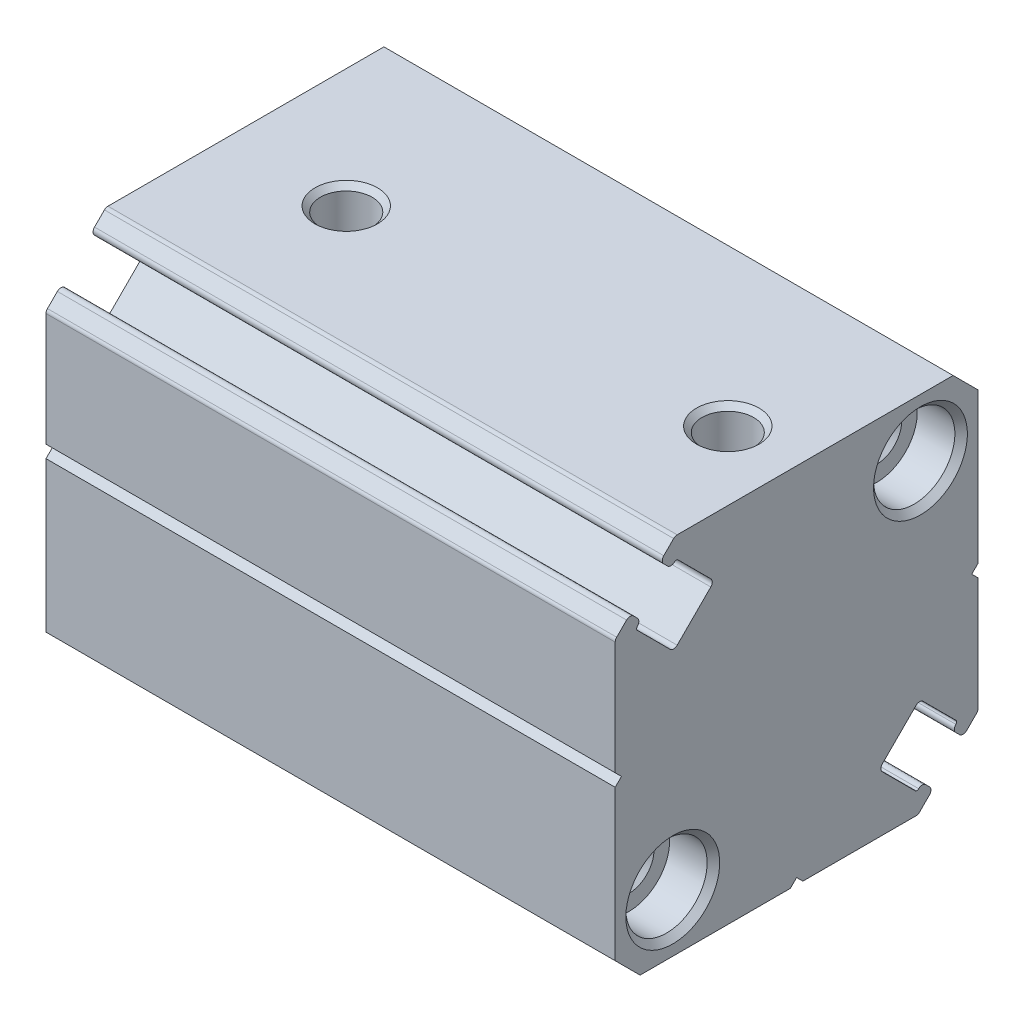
ISO-10303-21;
HEADER;
FILE_DESCRIPTION(('STEP AP214'),'2;1');
FILE_NAME('part.step','',(''),(''),'','','');
FILE_SCHEMA(('AUTOMOTIVE_DESIGN { 1 0 10303 214 1 1 1 1 }'));
ENDSEC;
DATA;
#1=APPLICATION_CONTEXT('core data for automotive mechanical design processes');
#2=APPLICATION_PROTOCOL_DEFINITION('international standard','automotive_design',2000,#1);
#3=PRODUCT_CONTEXT('',#1,'mechanical');
#4=PRODUCT('Part','Part','',(#3));
#5=PRODUCT_RELATED_PRODUCT_CATEGORY('part','',(#4));
#6=PRODUCT_DEFINITION_FORMATION('','',#4);
#7=PRODUCT_DEFINITION_CONTEXT('part definition',#1,'design');
#8=PRODUCT_DEFINITION('design','',#6,#7);
#9=PRODUCT_DEFINITION_SHAPE('','',#8);
#10=(LENGTH_UNIT() NAMED_UNIT(*) SI_UNIT(.MILLI.,.METRE.));
#11=(NAMED_UNIT(*) PLANE_ANGLE_UNIT() SI_UNIT($,.RADIAN.));
#12=(NAMED_UNIT(*) SI_UNIT($,.STERADIAN.) SOLID_ANGLE_UNIT());
#13=UNCERTAINTY_MEASURE_WITH_UNIT(LENGTH_MEASURE(1.E-05),#10,'distance_accuracy_value','');
#14=(GEOMETRIC_REPRESENTATION_CONTEXT(3) GLOBAL_UNCERTAINTY_ASSIGNED_CONTEXT((#13)) GLOBAL_UNIT_ASSIGNED_CONTEXT((#10,
#11,#12)) REPRESENTATION_CONTEXT('',''));
#15=CARTESIAN_POINT('',(0.,0.,0.));
#16=DIRECTION('',(0.,0.,1.));
#17=DIRECTION('',(1.,0.,0.));
#18=AXIS2_PLACEMENT_3D('',#15,#16,#17);
#19=CARTESIAN_POINT('',(45.5,9.54565076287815,14.1));
#20=DIRECTION('',(-1.,0.,0.));
#21=DIRECTION('',(0.,0.,1.));
#22=AXIS2_PLACEMENT_3D('',#19,#20,#21);
#23=CYLINDRICAL_SURFACE('',#22,0.39999999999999);
#24=CARTESIAN_POINT('',(0.,9.54565076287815,14.1));
#25=DIRECTION('',(1.,0.,0.));
#26=DIRECTION('',(0.,0.,-1.));
#27=AXIS2_PLACEMENT_3D('',#24,#25,#26);
#28=CIRCLE('',#27,0.39999999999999);
#29=CARTESIAN_POINT('',(0.,9.82849347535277,14.3828427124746));
#30=VERTEX_POINT('',#29);
#31=CARTESIAN_POINT('',(0.,9.54565076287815,14.5));
#32=VERTEX_POINT('',#31);
#33=EDGE_CURVE('E359',#30,#32,#28,.T.);
#34=ORIENTED_EDGE('',*,*,#33,.T.);
#35=DIRECTION('',(-1.,0.,0.));
#36=VECTOR('',#35,1.);
#37=CARTESIAN_POINT('',(45.5,9.54565076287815,14.5));
#38=LINE('',#37,#36);
#39=CARTESIAN_POINT('',(45.5,9.54565076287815,14.5));
#40=VERTEX_POINT('',#39);
#41=EDGE_CURVE('E24',#40,#32,#38,.T.);
#42=ORIENTED_EDGE('',*,*,#41,.F.);
#43=CARTESIAN_POINT('',(45.5,9.54565076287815,14.1));
#44=DIRECTION('',(1.,0.,0.));
#45=DIRECTION('',(0.,0.,-1.));
#46=AXIS2_PLACEMENT_3D('',#43,#44,#45);
#47=CIRCLE('',#46,0.39999999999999);
#48=CARTESIAN_POINT('',(45.5,9.82849347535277,14.3828427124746));
#49=VERTEX_POINT('',#48);
#50=EDGE_CURVE('E456',#49,#40,#47,.T.);
#51=ORIENTED_EDGE('',*,*,#50,.F.);
#52=DIRECTION('',(-1.,0.,0.));
#53=VECTOR('',#52,1.);
#54=CARTESIAN_POINT('',(45.5,9.82849347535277,14.3828427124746));
#55=LINE('',#54,#53);
#56=EDGE_CURVE('E355',#49,#30,#55,.T.);
#57=ORIENTED_EDGE('',*,*,#56,.T.);
#58=EDGE_LOOP('',(#34,#42,#51,#57));
#59=FACE_BOUND('',#58,.T.);
#60=ADVANCED_FACE('F16',(#59),#23,.T.);
#61=CARTESIAN_POINT('',(45.5,9.54565076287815,14.5));
#62=DIRECTION('',(0.,0.,-1.));
#63=DIRECTION('',(-1.,0.,0.));
#64=AXIS2_PLACEMENT_3D('',#61,#62,#63);
#65=PLANE('',#64);
#66=DIRECTION('',(0.,-1.,0.));
#67=VECTOR('',#66,1.);
#68=CARTESIAN_POINT('',(0.,9.54565076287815,14.5));
#69=LINE('',#68,#67);
#70=CARTESIAN_POINT('',(0.,0.5,14.5));
#71=VERTEX_POINT('',#70);
#72=EDGE_CURVE('E362',#32,#71,#69,.T.);
#73=ORIENTED_EDGE('',*,*,#72,.T.);
#74=DIRECTION('',(-1.,0.,0.));
#75=VECTOR('',#74,1.);
#76=CARTESIAN_POINT('',(45.5,0.5,14.5));
#77=LINE('',#76,#75);
#78=CARTESIAN_POINT('',(45.5,0.5,14.5));
#79=VERTEX_POINT('',#78);
#80=EDGE_CURVE('E589',#79,#71,#77,.T.);
#81=ORIENTED_EDGE('',*,*,#80,.F.);
#82=DIRECTION('',(0.,-1.,0.));
#83=VECTOR('',#82,1.);
#84=CARTESIAN_POINT('',(45.5,9.54565076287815,14.5));
#85=LINE('',#84,#83);
#86=EDGE_CURVE('E199',#40,#79,#85,.T.);
#87=ORIENTED_EDGE('',*,*,#86,.F.);
#88=ORIENTED_EDGE('',*,*,#41,.T.);
#89=EDGE_LOOP('',(#73,#81,#87,#88));
#90=FACE_BOUND('',#89,.T.);
#91=ADVANCED_FACE('F592',(#90),#65,.F.);
#92=CARTESIAN_POINT('',(45.5,0.5,14.5));
#93=DIRECTION('',(0.,0.707106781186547,-0.707106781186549));
#94=DIRECTION('',(0.,0.707106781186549,0.707106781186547));
#95=AXIS2_PLACEMENT_3D('',#92,#93,#94);
#96=PLANE('',#95);
#97=DIRECTION('',(0.,-0.707106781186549,-0.707106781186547));
#98=VECTOR('',#97,1.);
#99=CARTESIAN_POINT('',(0.,0.5,14.5));
#100=LINE('',#99,#98);
#101=CARTESIAN_POINT('',(0.,0.,14.));
#102=VERTEX_POINT('',#101);
#103=EDGE_CURVE('E365',#71,#102,#100,.T.);
#104=ORIENTED_EDGE('',*,*,#103,.T.);
#105=DIRECTION('',(-1.,0.,0.));
#106=VECTOR('',#105,1.);
#107=CARTESIAN_POINT('',(45.5,0.,14.));
#108=LINE('',#107,#106);
#109=CARTESIAN_POINT('',(45.5,0.,14.));
#110=VERTEX_POINT('',#109);
#111=EDGE_CURVE('E586',#110,#102,#108,.T.);
#112=ORIENTED_EDGE('',*,*,#111,.F.);
#113=DIRECTION('',(0.,-0.707106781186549,-0.707106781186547));
#114=VECTOR('',#113,1.);
#115=CARTESIAN_POINT('',(45.5,0.5,14.5));
#116=LINE('',#115,#114);
#117=EDGE_CURVE('E612',#79,#110,#116,.T.);
#118=ORIENTED_EDGE('',*,*,#117,.F.);
#119=ORIENTED_EDGE('',*,*,#80,.T.);
#120=EDGE_LOOP('',(#104,#112,#118,#119));
#121=FACE_BOUND('',#120,.T.);
#122=ADVANCED_FACE('F603',(#121),#96,.F.);
#123=CARTESIAN_POINT('',(45.5,0.,14.));
#124=DIRECTION('',(0.,-0.707106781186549,-0.707106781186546));
#125=DIRECTION('',(0.,0.707106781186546,-0.707106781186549));
#126=AXIS2_PLACEMENT_3D('',#123,#124,#125);
#127=PLANE('',#126);
#128=DIRECTION('',(0.,-0.707106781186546,0.707106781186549));
#129=VECTOR('',#128,1.);
#130=CARTESIAN_POINT('',(0.,0.,14.));
#131=LINE('',#130,#129);
#132=CARTESIAN_POINT('',(0.,-0.5,14.5));
#133=VERTEX_POINT('',#132);
#134=EDGE_CURVE('E367',#102,#133,#131,.T.);
#135=ORIENTED_EDGE('',*,*,#134,.T.);
#136=DIRECTION('',(-1.,0.,0.));
#137=VECTOR('',#136,1.);
#138=CARTESIAN_POINT('',(45.5,-0.5,14.5));
#139=LINE('',#138,#137);
#140=CARTESIAN_POINT('',(45.5,-0.5,14.5));
#141=VERTEX_POINT('',#140);
#142=EDGE_CURVE('E583',#141,#133,#139,.T.);
#143=ORIENTED_EDGE('',*,*,#142,.F.);
#144=DIRECTION('',(0.,-0.707106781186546,0.707106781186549));
#145=VECTOR('',#144,1.);
#146=CARTESIAN_POINT('',(45.5,0.,14.));
#147=LINE('',#146,#145);
#148=EDGE_CURVE('E609',#110,#141,#147,.T.);
#149=ORIENTED_EDGE('',*,*,#148,.F.);
#150=ORIENTED_EDGE('',*,*,#111,.T.);
#151=EDGE_LOOP('',(#135,#143,#149,#150));
#152=FACE_BOUND('',#151,.T.);
#153=ADVANCED_FACE('F607',(#152),#127,.F.);
#154=CARTESIAN_POINT('',(45.5,-0.5,14.5));
#155=DIRECTION('',(0.,0.,-1.));
#156=DIRECTION('',(-1.,0.,0.));
#157=AXIS2_PLACEMENT_3D('',#154,#155,#156);
#158=PLANE('',#157);
#159=DIRECTION('',(0.,-1.,0.));
#160=VECTOR('',#159,1.);
#161=CARTESIAN_POINT('',(0.,-0.5,14.5));
#162=LINE('',#161,#160);
#163=CARTESIAN_POINT('',(0.,-12.5114790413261,14.5));
#164=VERTEX_POINT('',#163);
#165=EDGE_CURVE('E369',#133,#164,#162,.T.);
#166=ORIENTED_EDGE('',*,*,#165,.T.);
#167=DIRECTION('',(-1.,0.,0.));
#168=VECTOR('',#167,1.);
#169=CARTESIAN_POINT('',(45.5,-12.5114790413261,14.5));
#170=LINE('',#169,#168);
#171=CARTESIAN_POINT('',(45.5,-12.5114790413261,14.5));
#172=VERTEX_POINT('',#171);
#173=EDGE_CURVE('E580',#172,#164,#170,.T.);
#174=ORIENTED_EDGE('',*,*,#173,.F.);
#175=DIRECTION('',(0.,-1.,0.));
#176=VECTOR('',#175,1.);
#177=CARTESIAN_POINT('',(45.5,-0.5,14.5));
#178=LINE('',#177,#176);
#179=EDGE_CURVE('E611',#141,#172,#178,.T.);
#180=ORIENTED_EDGE('',*,*,#179,.F.);
#181=ORIENTED_EDGE('',*,*,#142,.T.);
#182=EDGE_LOOP('',(#166,#174,#180,#181));
#183=FACE_BOUND('',#182,.T.);
#184=ADVANCED_FACE('F902',(#183),#158,.F.);
#185=CARTESIAN_POINT('',(45.5,-12.5114790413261,14.5));
#186=DIRECTION('',(0.,0.707106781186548,-0.707106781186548));
#187=DIRECTION('',(0.,0.707106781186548,0.707106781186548));
#188=AXIS2_PLACEMENT_3D('',#185,#186,#187);
#189=PLANE('',#188);
#190=DIRECTION('',(0.,-0.707106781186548,-0.707106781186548));
#191=VECTOR('',#190,1.);
#192=CARTESIAN_POINT('',(0.,-12.5114790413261,14.5));
#193=LINE('',#192,#191);
#194=CARTESIAN_POINT('',(0.,-14.5,12.5114790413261));
#195=VERTEX_POINT('',#194);
#196=EDGE_CURVE('E371',#164,#195,#193,.T.);
#197=ORIENTED_EDGE('',*,*,#196,.T.);
#198=DIRECTION('',(-1.,0.,0.));
#199=VECTOR('',#198,1.);
#200=CARTESIAN_POINT('',(45.5,-14.5,12.5114790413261));
#201=LINE('',#200,#199);
#202=CARTESIAN_POINT('',(45.5,-14.5,12.5114790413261));
#203=VERTEX_POINT('',#202);
#204=EDGE_CURVE('E577',#203,#195,#201,.T.);
#205=ORIENTED_EDGE('',*,*,#204,.F.);
#206=DIRECTION('',(0.,-0.707106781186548,-0.707106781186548));
#207=VECTOR('',#206,1.);
#208=CARTESIAN_POINT('',(45.5,-12.5114790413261,14.5));
#209=LINE('',#208,#207);
#210=EDGE_CURVE('E614',#172,#203,#209,.T.);
#211=ORIENTED_EDGE('',*,*,#210,.F.);
#212=ORIENTED_EDGE('',*,*,#173,.T.);
#213=EDGE_LOOP('',(#197,#205,#211,#212));
#214=FACE_BOUND('',#213,.T.);
#215=ADVANCED_FACE('F899',(#214),#189,.F.);
#216=CARTESIAN_POINT('',(45.5,-14.5,12.5114790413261));
#217=DIRECTION('',(0.,1.,0.));
#218=DIRECTION('',(0.,0.,1.));
#219=AXIS2_PLACEMENT_3D('',#216,#217,#218);
#220=PLANE('',#219);
#221=DIRECTION('',(0.,0.,-1.));
#222=VECTOR('',#221,1.);
#223=CARTESIAN_POINT('',(0.,-14.5,12.5114790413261));
#224=LINE('',#223,#222);
#225=CARTESIAN_POINT('',(0.,-14.5,0.5));
#226=VERTEX_POINT('',#225);
#227=EDGE_CURVE('E373',#195,#226,#224,.T.);
#228=ORIENTED_EDGE('',*,*,#227,.T.);
#229=DIRECTION('',(-1.,0.,0.));
#230=VECTOR('',#229,1.);
#231=CARTESIAN_POINT('',(45.5,-14.5,0.5));
#232=LINE('',#231,#230);
#233=CARTESIAN_POINT('',(45.5,-14.5,0.5));
#234=VERTEX_POINT('',#233);
#235=EDGE_CURVE('E574',#234,#226,#232,.T.);
#236=ORIENTED_EDGE('',*,*,#235,.F.);
#237=DIRECTION('',(0.,0.,-1.));
#238=VECTOR('',#237,1.);
#239=CARTESIAN_POINT('',(45.5,-14.5,12.5114790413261));
#240=LINE('',#239,#238);
#241=EDGE_CURVE('E620',#203,#234,#240,.T.);
#242=ORIENTED_EDGE('',*,*,#241,.F.);
#243=ORIENTED_EDGE('',*,*,#204,.T.);
#244=EDGE_LOOP('',(#228,#236,#242,#243));
#245=FACE_BOUND('',#244,.T.);
#246=ADVANCED_FACE('F895',(#245),#220,.F.);
#247=CARTESIAN_POINT('',(45.5,-14.5,0.5));
#248=DIRECTION('',(0.,0.707106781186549,0.707106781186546));
#249=DIRECTION('',(0.,-0.707106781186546,0.707106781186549));
#250=AXIS2_PLACEMENT_3D('',#247,#248,#249);
#251=PLANE('',#250);
#252=DIRECTION('',(0.,0.707106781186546,-0.707106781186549));
#253=VECTOR('',#252,1.);
#254=CARTESIAN_POINT('',(0.,-14.5,0.5));
#255=LINE('',#254,#253);
#256=CARTESIAN_POINT('',(0.,-14.,0.));
#257=VERTEX_POINT('',#256);
#258=EDGE_CURVE('E375',#226,#257,#255,.T.);
#259=ORIENTED_EDGE('',*,*,#258,.T.);
#260=DIRECTION('',(-1.,0.,0.));
#261=VECTOR('',#260,1.);
#262=CARTESIAN_POINT('',(45.5,-14.,0.));
#263=LINE('',#262,#261);
#264=CARTESIAN_POINT('',(45.5,-14.,0.));
#265=VERTEX_POINT('',#264);
#266=EDGE_CURVE('E571',#265,#257,#263,.T.);
#267=ORIENTED_EDGE('',*,*,#266,.F.);
#268=DIRECTION('',(0.,0.707106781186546,-0.707106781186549));
#269=VECTOR('',#268,1.);
#270=CARTESIAN_POINT('',(45.5,-14.5,0.5));
#271=LINE('',#270,#269);
#272=EDGE_CURVE('E622',#234,#265,#271,.T.);
#273=ORIENTED_EDGE('',*,*,#272,.F.);
#274=ORIENTED_EDGE('',*,*,#235,.T.);
#275=EDGE_LOOP('',(#259,#267,#273,#274));
#276=FACE_BOUND('',#275,.T.);
#277=ADVANCED_FACE('F890',(#276),#251,.F.);
#278=CARTESIAN_POINT('',(45.5,-14.,0.));
#279=DIRECTION('',(0.,0.707106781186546,-0.707106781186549));
#280=DIRECTION('',(0.,0.707106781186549,0.707106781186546));
#281=AXIS2_PLACEMENT_3D('',#278,#279,#280);
#282=PLANE('',#281);
#283=DIRECTION('',(0.,-0.707106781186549,-0.707106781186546));
#284=VECTOR('',#283,1.);
#285=CARTESIAN_POINT('',(0.,-14.,0.));
#286=LINE('',#285,#284);
#287=CARTESIAN_POINT('',(0.,-14.5,-0.5));
#288=VERTEX_POINT('',#287);
#289=EDGE_CURVE('E377',#257,#288,#286,.T.);
#290=ORIENTED_EDGE('',*,*,#289,.T.);
#291=DIRECTION('',(-1.,0.,0.));
#292=VECTOR('',#291,1.);
#293=CARTESIAN_POINT('',(45.5,-14.5,-0.5));
#294=LINE('',#293,#292);
#295=CARTESIAN_POINT('',(45.5,-14.5,-0.5));
#296=VERTEX_POINT('',#295);
#297=EDGE_CURVE('E568',#296,#288,#294,.T.);
#298=ORIENTED_EDGE('',*,*,#297,.F.);
#299=DIRECTION('',(0.,-0.707106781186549,-0.707106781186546));
#300=VECTOR('',#299,1.);
#301=CARTESIAN_POINT('',(45.5,-14.,0.));
#302=LINE('',#301,#300);
#303=EDGE_CURVE('E624',#265,#296,#302,.T.);
#304=ORIENTED_EDGE('',*,*,#303,.F.);
#305=ORIENTED_EDGE('',*,*,#266,.T.);
#306=EDGE_LOOP('',(#290,#298,#304,#305));
#307=FACE_BOUND('',#306,.T.);
#308=ADVANCED_FACE('F884',(#307),#282,.F.);
#309=CARTESIAN_POINT('',(45.5,-14.5,-0.5));
#310=DIRECTION('',(0.,1.,0.));
#311=DIRECTION('',(0.,0.,1.));
#312=AXIS2_PLACEMENT_3D('',#309,#310,#311);
#313=PLANE('',#312);
#314=DIRECTION('',(0.,0.,-1.));
#315=VECTOR('',#314,1.);
#316=CARTESIAN_POINT('',(0.,-14.5,-0.5));
#317=LINE('',#316,#315);
#318=CARTESIAN_POINT('',(0.,-14.5,-9.54565076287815));
#319=VERTEX_POINT('',#318);
#320=EDGE_CURVE('E379',#288,#319,#317,.T.);
#321=ORIENTED_EDGE('',*,*,#320,.T.);
#322=DIRECTION('',(-1.,0.,0.));
#323=VECTOR('',#322,1.);
#324=CARTESIAN_POINT('',(45.5,-14.5,-9.54565076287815));
#325=LINE('',#324,#323);
#326=CARTESIAN_POINT('',(45.5,-14.5,-9.54565076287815));
#327=VERTEX_POINT('',#326);
#328=EDGE_CURVE('E565',#327,#319,#325,.T.);
#329=ORIENTED_EDGE('',*,*,#328,.F.);
#330=DIRECTION('',(0.,0.,-1.));
#331=VECTOR('',#330,1.);
#332=CARTESIAN_POINT('',(45.5,-14.5,-0.5));
#333=LINE('',#332,#331);
#334=EDGE_CURVE('E626',#296,#327,#333,.T.);
#335=ORIENTED_EDGE('',*,*,#334,.F.);
#336=ORIENTED_EDGE('',*,*,#297,.T.);
#337=EDGE_LOOP('',(#321,#329,#335,#336));
#338=FACE_BOUND('',#337,.T.);
#339=ADVANCED_FACE('F880',(#338),#313,.F.);
#340=CARTESIAN_POINT('',(45.5,-14.1,-9.54565076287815));
#341=DIRECTION('',(-1.,0.,0.));
#342=DIRECTION('',(0.,0.,1.));
#343=AXIS2_PLACEMENT_3D('',#340,#341,#342);
#344=CYLINDRICAL_SURFACE('',#343,0.400000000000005);
#345=CARTESIAN_POINT('',(0.,-14.1,-9.54565076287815));
#346=DIRECTION('',(1.,0.,0.));
#347=DIRECTION('',(0.,0.,-1.));
#348=AXIS2_PLACEMENT_3D('',#345,#346,#347);
#349=CIRCLE('',#348,0.400000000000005);
#350=CARTESIAN_POINT('',(0.,-14.3828427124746,-9.82849347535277));
#351=VERTEX_POINT('',#350);
#352=EDGE_CURVE('E381',#319,#351,#349,.T.);
#353=ORIENTED_EDGE('',*,*,#352,.T.);
#354=DIRECTION('',(-1.,0.,0.));
#355=VECTOR('',#354,1.);
#356=CARTESIAN_POINT('',(45.5,-14.3828427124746,-9.82849347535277));
#357=LINE('',#356,#355);
#358=CARTESIAN_POINT('',(45.5,-14.3828427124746,-9.82849347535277));
#359=VERTEX_POINT('',#358);
#360=EDGE_CURVE('E562',#359,#351,#357,.T.);
#361=ORIENTED_EDGE('',*,*,#360,.F.);
#362=CARTESIAN_POINT('',(45.5,-14.1,-9.54565076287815));
#363=DIRECTION('',(1.,0.,0.));
#364=DIRECTION('',(0.,0.,-1.));
#365=AXIS2_PLACEMENT_3D('',#362,#363,#364);
#366=CIRCLE('',#365,0.400000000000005);
#367=EDGE_CURVE('E628',#327,#359,#366,.T.);
#368=ORIENTED_EDGE('',*,*,#367,.F.);
#369=ORIENTED_EDGE('',*,*,#328,.T.);
#370=EDGE_LOOP('',(#353,#361,#368,#369));
#371=FACE_BOUND('',#370,.T.);
#372=ADVANCED_FACE('F875',(#371),#344,.T.);
#373=CARTESIAN_POINT('',(45.5,-14.3828427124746,-9.82849347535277));
#374=DIRECTION('',(0.,0.707106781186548,0.707106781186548));
#375=DIRECTION('',(0.,-0.707106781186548,0.707106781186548));
#376=AXIS2_PLACEMENT_3D('',#373,#374,#375);
#377=PLANE('',#376);
#378=DIRECTION('',(0.,0.707106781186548,-0.707106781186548));
#379=VECTOR('',#378,1.);
#380=CARTESIAN_POINT('',(0.,-14.3828427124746,-9.82849347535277));
#381=LINE('',#380,#379);
#382=CARTESIAN_POINT('',(0.,-13.5905923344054,-10.6207438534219));
#383=VERTEX_POINT('',#382);
#384=EDGE_CURVE('E383',#351,#383,#381,.T.);
#385=ORIENTED_EDGE('',*,*,#384,.T.);
#386=DIRECTION('',(-1.,0.,0.));
#387=VECTOR('',#386,1.);
#388=CARTESIAN_POINT('',(45.5,-13.5905923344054,-10.6207438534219));
#389=LINE('',#388,#387);
#390=CARTESIAN_POINT('',(45.5,-13.5905923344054,-10.6207438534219));
#391=VERTEX_POINT('',#390);
#392=EDGE_CURVE('E559',#391,#383,#389,.T.);
#393=ORIENTED_EDGE('',*,*,#392,.F.);
#394=DIRECTION('',(0.,0.707106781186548,-0.707106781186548));
#395=VECTOR('',#394,1.);
#396=CARTESIAN_POINT('',(45.5,-14.3828427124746,-9.82849347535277));
#397=LINE('',#396,#395);
#398=EDGE_CURVE('E630',#359,#391,#397,.T.);
#399=ORIENTED_EDGE('',*,*,#398,.F.);
#400=ORIENTED_EDGE('',*,*,#360,.T.);
#401=EDGE_LOOP('',(#385,#393,#399,#400));
#402=FACE_BOUND('',#401,.T.);
#403=ADVANCED_FACE('F869',(#402),#377,.F.);
#404=CARTESIAN_POINT('',(45.5,-13.3077496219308,-10.3379011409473));
#405=DIRECTION('',(-1.,0.,0.));
#406=DIRECTION('',(0.,0.,1.));
#407=AXIS2_PLACEMENT_3D('',#404,#405,#406);
#408=CYLINDRICAL_SURFACE('',#407,0.4);
#409=CARTESIAN_POINT('',(0.,-13.3077496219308,-10.3379011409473));
#410=DIRECTION('',(1.,0.,0.));
#411=DIRECTION('',(0.,0.,-1.));
#412=AXIS2_PLACEMENT_3D('',#409,#410,#411);
#413=CIRCLE('',#412,0.4);
#414=CARTESIAN_POINT('',(0.,-13.0249069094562,-10.6207438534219));
#415=VERTEX_POINT('',#414);
#416=EDGE_CURVE('E385',#383,#415,#413,.T.);
#417=ORIENTED_EDGE('',*,*,#416,.T.);
#418=DIRECTION('',(-1.,0.,0.));
#419=VECTOR('',#418,1.);
#420=CARTESIAN_POINT('',(45.5,-13.0249069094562,-10.6207438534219));
#421=LINE('',#420,#419);
#422=CARTESIAN_POINT('',(45.5,-13.0249069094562,-10.6207438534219));
#423=VERTEX_POINT('',#422);
#424=EDGE_CURVE('E556',#423,#415,#421,.T.);
#425=ORIENTED_EDGE('',*,*,#424,.F.);
#426=CARTESIAN_POINT('',(45.5,-13.3077496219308,-10.3379011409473));
#427=DIRECTION('',(1.,0.,0.));
#428=DIRECTION('',(0.,0.,-1.));
#429=AXIS2_PLACEMENT_3D('',#426,#427,#428);
#430=CIRCLE('',#429,0.4);
#431=EDGE_CURVE('E632',#391,#423,#430,.T.);
#432=ORIENTED_EDGE('',*,*,#431,.F.);
#433=ORIENTED_EDGE('',*,*,#392,.T.);
#434=EDGE_LOOP('',(#417,#425,#432,#433));
#435=FACE_BOUND('',#434,.T.);
#436=ADVANCED_FACE('F865',(#435),#408,.T.);
#437=CARTESIAN_POINT('',(45.5,-13.0249069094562,-10.6207438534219));
#438=DIRECTION('',(0.,-0.707106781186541,0.707106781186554));
#439=DIRECTION('',(0.,-0.707106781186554,-0.707106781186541));
#440=AXIS2_PLACEMENT_3D('',#437,#438,#439);
#441=PLANE('',#440);
#442=DIRECTION('',(0.,0.707106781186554,0.707106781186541));
#443=VECTOR('',#442,1.);
#444=CARTESIAN_POINT('',(0.,-13.0249069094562,-10.6207438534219));
#445=LINE('',#444,#443);
#446=CARTESIAN_POINT('',(0.,-12.7279220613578,-10.3237590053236));
#447=VERTEX_POINT('',#446);
#448=EDGE_CURVE('E387',#415,#447,#445,.T.);
#449=ORIENTED_EDGE('',*,*,#448,.T.);
#450=DIRECTION('',(-1.,0.,0.));
#451=VECTOR('',#450,1.);
#452=CARTESIAN_POINT('',(45.5,-12.7279220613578,-10.3237590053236));
#453=LINE('',#452,#451);
#454=CARTESIAN_POINT('',(45.5,-12.7279220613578,-10.3237590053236));
#455=VERTEX_POINT('',#454);
#456=EDGE_CURVE('E553',#455,#447,#453,.T.);
#457=ORIENTED_EDGE('',*,*,#456,.F.);
#458=DIRECTION('',(0.,0.707106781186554,0.707106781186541));
#459=VECTOR('',#458,1.);
#460=CARTESIAN_POINT('',(45.5,-13.0249069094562,-10.6207438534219));
#461=LINE('',#460,#459);
#462=EDGE_CURVE('E634',#423,#455,#461,.T.);
#463=ORIENTED_EDGE('',*,*,#462,.F.);
#464=ORIENTED_EDGE('',*,*,#424,.T.);
#465=EDGE_LOOP('',(#449,#457,#463,#464));
#466=FACE_BOUND('',#465,.T.);
#467=ADVANCED_FACE('F860',(#466),#441,.F.);
#468=CARTESIAN_POINT('',(45.5,-13.0107647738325,-10.040916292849));
#469=DIRECTION('',(-1.,0.,0.));
#470=DIRECTION('',(0.,0.,1.));
#471=AXIS2_PLACEMENT_3D('',#468,#469,#470);
#472=CYLINDRICAL_SURFACE('',#471,0.4);
#473=CARTESIAN_POINT('',(0.,-13.0107647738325,-10.040916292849));
#474=DIRECTION('',(1.,0.,0.));
#475=DIRECTION('',(0.,0.,-1.));
#476=AXIS2_PLACEMENT_3D('',#473,#474,#475);
#477=CIRCLE('',#476,0.4);
#478=CARTESIAN_POINT('',(0.,-12.7279220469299,-9.75807359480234));
#479=VERTEX_POINT('',#478);
#480=EDGE_CURVE('E389',#447,#479,#477,.T.);
#481=ORIENTED_EDGE('',*,*,#480,.T.);
#482=DIRECTION('',(-1.,0.,0.));
#483=VECTOR('',#482,1.);
#484=CARTESIAN_POINT('',(45.5,-12.7279220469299,-9.75807359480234));
#485=LINE('',#484,#483);
#486=CARTESIAN_POINT('',(45.5,-12.7279220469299,-9.75807359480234));
#487=VERTEX_POINT('',#486);
#488=EDGE_CURVE('E550',#487,#479,#485,.T.);
#489=ORIENTED_EDGE('',*,*,#488,.F.);
#490=CARTESIAN_POINT('',(45.5,-13.0107647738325,-10.040916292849));
#491=DIRECTION('',(1.,0.,0.));
#492=DIRECTION('',(0.,0.,-1.));
#493=AXIS2_PLACEMENT_3D('',#490,#491,#492);
#494=CIRCLE('',#493,0.4);
#495=EDGE_CURVE('E636',#455,#487,#494,.T.);
#496=ORIENTED_EDGE('',*,*,#495,.F.);
#497=ORIENTED_EDGE('',*,*,#456,.T.);
#498=EDGE_LOOP('',(#481,#489,#496,#497));
#499=FACE_BOUND('',#498,.T.);
#500=ADVANCED_FACE('F854',(#499),#472,.T.);
#501=CARTESIAN_POINT('',(45.5,-12.5865007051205,-9.61665222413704));
#502=DIRECTION('',(-1.,0.,0.));
#503=DIRECTION('',(0.,0.,1.));
#504=AXIS2_PLACEMENT_3D('',#501,#502,#503);
#505=CYLINDRICAL_SURFACE('',#504,0.199999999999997);
#506=CARTESIAN_POINT('',(0.,-12.5865007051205,-9.61665222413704));
#507=DIRECTION('',(-1.,0.,0.));
#508=DIRECTION('',(0.,0.,1.));
#509=AXIS2_PLACEMENT_3D('',#506,#507,#508);
#510=CIRCLE('',#509,0.199999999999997);
#511=CARTESIAN_POINT('',(0.,-12.7279220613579,-9.47523086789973));
#512=VERTEX_POINT('',#511);
#513=EDGE_CURVE('E391',#479,#512,#510,.T.);
#514=ORIENTED_EDGE('',*,*,#513,.T.);
#515=DIRECTION('',(-1.,0.,0.));
#516=VECTOR('',#515,1.);
#517=CARTESIAN_POINT('',(45.5,-12.7279220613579,-9.47523086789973));
#518=LINE('',#517,#516);
#519=CARTESIAN_POINT('',(45.5,-12.7279220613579,-9.47523086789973));
#520=VERTEX_POINT('',#519);
#521=EDGE_CURVE('E547',#520,#512,#518,.T.);
#522=ORIENTED_EDGE('',*,*,#521,.F.);
#523=CARTESIAN_POINT('',(45.5,-12.5865007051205,-9.61665222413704));
#524=DIRECTION('',(-1.,0.,0.));
#525=DIRECTION('',(0.,0.,1.));
#526=AXIS2_PLACEMENT_3D('',#523,#524,#525);
#527=CIRCLE('',#526,0.199999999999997);
#528=EDGE_CURVE('E638',#487,#520,#527,.T.);
#529=ORIENTED_EDGE('',*,*,#528,.F.);
#530=ORIENTED_EDGE('',*,*,#488,.T.);
#531=EDGE_LOOP('',(#514,#522,#529,#530));
#532=FACE_BOUND('',#531,.T.);
#533=ADVANCED_FACE('F850',(#532),#505,.F.);
#534=CARTESIAN_POINT('',(45.5,-12.7279220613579,-9.47523086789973));
#535=DIRECTION('',(0.,-0.707106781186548,0.707106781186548));
#536=DIRECTION('',(0.,-0.707106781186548,-0.707106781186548));
#537=AXIS2_PLACEMENT_3D('',#534,#535,#536);
#538=PLANE('',#537);
#539=DIRECTION('',(0.,0.707106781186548,0.707106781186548));
#540=VECTOR('',#539,1.);
#541=CARTESIAN_POINT('',(0.,-12.7279220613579,-9.47523086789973));
#542=LINE('',#541,#540);
#543=CARTESIAN_POINT('',(0.,-10.1116269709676,-6.85893577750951));
#544=VERTEX_POINT('',#543);
#545=EDGE_CURVE('E393',#512,#544,#542,.T.);
#546=ORIENTED_EDGE('',*,*,#545,.T.);
#547=DIRECTION('',(-1.,0.,0.));
#548=VECTOR('',#547,1.);
#549=CARTESIAN_POINT('',(45.5,-10.1116269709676,-6.85893577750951));
#550=LINE('',#549,#548);
#551=CARTESIAN_POINT('',(45.5,-10.1116269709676,-6.85893577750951));
#552=VERTEX_POINT('',#551);
#553=EDGE_CURVE('E544',#552,#544,#550,.T.);
#554=ORIENTED_EDGE('',*,*,#553,.F.);
#555=DIRECTION('',(0.,0.707106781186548,0.707106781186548));
#556=VECTOR('',#555,1.);
#557=CARTESIAN_POINT('',(45.5,-12.7279220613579,-9.47523086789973));
#558=LINE('',#557,#556);
#559=EDGE_CURVE('E640',#520,#552,#558,.T.);
#560=ORIENTED_EDGE('',*,*,#559,.F.);
#561=ORIENTED_EDGE('',*,*,#521,.T.);
#562=EDGE_LOOP('',(#546,#554,#560,#561));
#563=FACE_BOUND('',#562,.T.);
#564=ADVANCED_FACE('F845',(#563),#538,.F.);
#565=CARTESIAN_POINT('',(45.5,-9.82878425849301,-7.14177848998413));
#566=DIRECTION('',(-1.,0.,0.));
#567=DIRECTION('',(0.,0.,1.));
#568=AXIS2_PLACEMENT_3D('',#565,#566,#567);
#569=CYLINDRICAL_SURFACE('',#568,0.4);
#570=CARTESIAN_POINT('',(0.,-9.82878425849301,-7.14177848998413));
#571=DIRECTION('',(-1.,0.,0.));
#572=DIRECTION('',(0.,0.,1.));
#573=AXIS2_PLACEMENT_3D('',#570,#571,#572);
#574=CIRCLE('',#573,0.4);
#575=CARTESIAN_POINT('',(0.,-9.54594154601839,-6.85893577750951));
#576=VERTEX_POINT('',#575);
#577=EDGE_CURVE('E395',#544,#576,#574,.T.);
#578=ORIENTED_EDGE('',*,*,#577,.T.);
#579=DIRECTION('',(-1.,0.,0.));
#580=VECTOR('',#579,1.);
#581=CARTESIAN_POINT('',(45.5,-9.54594154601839,-6.85893577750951));
#582=LINE('',#581,#580);
#583=CARTESIAN_POINT('',(45.5,-9.54594154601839,-6.85893577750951));
#584=VERTEX_POINT('',#583);
#585=EDGE_CURVE('E541',#584,#576,#582,.T.);
#586=ORIENTED_EDGE('',*,*,#585,.F.);
#587=CARTESIAN_POINT('',(45.5,-9.82878425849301,-7.14177848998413));
#588=DIRECTION('',(-1.,0.,0.));
#589=DIRECTION('',(0.,0.,1.));
#590=AXIS2_PLACEMENT_3D('',#587,#588,#589);
#591=CIRCLE('',#590,0.4);
#592=EDGE_CURVE('E642',#552,#584,#591,.T.);
#593=ORIENTED_EDGE('',*,*,#592,.F.);
#594=ORIENTED_EDGE('',*,*,#553,.T.);
#595=EDGE_LOOP('',(#578,#586,#593,#594));
#596=FACE_BOUND('',#595,.T.);
#597=ADVANCED_FACE('F839',(#596),#569,.F.);
#598=CARTESIAN_POINT('',(45.5,-9.54594154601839,-6.85893577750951));
#599=DIRECTION('',(0.,0.707106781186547,0.707106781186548));
#600=DIRECTION('',(0.,-0.707106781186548,0.707106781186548));
#601=AXIS2_PLACEMENT_3D('',#598,#599,#600);
#602=PLANE('',#601);
#603=DIRECTION('',(0.,0.707106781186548,-0.707106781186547));
#604=VECTOR('',#603,1.);
#605=CARTESIAN_POINT('',(0.,-9.54594154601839,-6.85893577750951));
#606=LINE('',#605,#604);
#607=CARTESIAN_POINT('',(0.,-6.85893577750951,-9.54594154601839));
#608=VERTEX_POINT('',#607);
#609=EDGE_CURVE('E397',#576,#608,#606,.T.);
#610=ORIENTED_EDGE('',*,*,#609,.T.);
#611=DIRECTION('',(-1.,0.,0.));
#612=VECTOR('',#611,1.);
#613=CARTESIAN_POINT('',(45.5,-6.85893577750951,-9.54594154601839));
#614=LINE('',#613,#612);
#615=CARTESIAN_POINT('',(45.5,-6.85893577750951,-9.54594154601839));
#616=VERTEX_POINT('',#615);
#617=EDGE_CURVE('E538',#616,#608,#614,.T.);
#618=ORIENTED_EDGE('',*,*,#617,.F.);
#619=DIRECTION('',(0.,0.707106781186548,-0.707106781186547));
#620=VECTOR('',#619,1.);
#621=CARTESIAN_POINT('',(45.5,-9.54594154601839,-6.85893577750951));
#622=LINE('',#621,#620);
#623=EDGE_CURVE('E644',#584,#616,#622,.T.);
#624=ORIENTED_EDGE('',*,*,#623,.F.);
#625=ORIENTED_EDGE('',*,*,#585,.T.);
#626=EDGE_LOOP('',(#610,#618,#624,#625));
#627=FACE_BOUND('',#626,.T.);
#628=ADVANCED_FACE('F835',(#627),#602,.F.);
#629=CARTESIAN_POINT('',(45.5,-7.14177848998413,-9.82878425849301));
#630=DIRECTION('',(-1.,0.,0.));
#631=DIRECTION('',(0.,0.,1.));
#632=AXIS2_PLACEMENT_3D('',#629,#630,#631);
#633=CYLINDRICAL_SURFACE('',#632,0.4);
#634=CARTESIAN_POINT('',(0.,-7.14177848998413,-9.82878425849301));
#635=DIRECTION('',(-1.,0.,0.));
#636=DIRECTION('',(0.,0.,1.));
#637=AXIS2_PLACEMENT_3D('',#634,#635,#636);
#638=CIRCLE('',#637,0.4);
#639=CARTESIAN_POINT('',(0.,-6.85893577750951,-10.1116269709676));
#640=VERTEX_POINT('',#639);
#641=EDGE_CURVE('E399',#608,#640,#638,.T.);
#642=ORIENTED_EDGE('',*,*,#641,.T.);
#643=DIRECTION('',(-1.,0.,0.));
#644=VECTOR('',#643,1.);
#645=CARTESIAN_POINT('',(45.5,-6.85893577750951,-10.1116269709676));
#646=LINE('',#645,#644);
#647=CARTESIAN_POINT('',(45.5,-6.85893577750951,-10.1116269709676));
#648=VERTEX_POINT('',#647);
#649=EDGE_CURVE('E535',#648,#640,#646,.T.);
#650=ORIENTED_EDGE('',*,*,#649,.F.);
#651=CARTESIAN_POINT('',(45.5,-7.14177848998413,-9.82878425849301));
#652=DIRECTION('',(-1.,0.,0.));
#653=DIRECTION('',(0.,0.,1.));
#654=AXIS2_PLACEMENT_3D('',#651,#652,#653);
#655=CIRCLE('',#654,0.4);
#656=EDGE_CURVE('E646',#616,#648,#655,.T.);
#657=ORIENTED_EDGE('',*,*,#656,.F.);
#658=ORIENTED_EDGE('',*,*,#617,.T.);
#659=EDGE_LOOP('',(#642,#650,#657,#658));
#660=FACE_BOUND('',#659,.T.);
#661=ADVANCED_FACE('F830',(#660),#633,.F.);
#662=CARTESIAN_POINT('',(45.5,-6.85893577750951,-10.1116269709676));
#663=DIRECTION('',(0.,0.707106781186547,-0.707106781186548));
#664=DIRECTION('',(0.,0.707106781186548,0.707106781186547));
#665=AXIS2_PLACEMENT_3D('',#662,#663,#664);
#666=PLANE('',#665);
#667=DIRECTION('',(0.,-0.707106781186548,-0.707106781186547));
#668=VECTOR('',#667,1.);
#669=CARTESIAN_POINT('',(0.,-6.85893577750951,-10.1116269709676));
#670=LINE('',#669,#668);
#671=CARTESIAN_POINT('',(0.,-9.47523086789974,-12.7279220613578));
#672=VERTEX_POINT('',#671);
#673=EDGE_CURVE('E401',#640,#672,#670,.T.);
#674=ORIENTED_EDGE('',*,*,#673,.T.);
#675=DIRECTION('',(-1.,0.,0.));
#676=VECTOR('',#675,1.);
#677=CARTESIAN_POINT('',(45.5,-9.47523086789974,-12.7279220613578));
#678=LINE('',#677,#676);
#679=CARTESIAN_POINT('',(45.5,-9.47523086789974,-12.7279220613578));
#680=VERTEX_POINT('',#679);
#681=EDGE_CURVE('E532',#680,#672,#678,.T.);
#682=ORIENTED_EDGE('',*,*,#681,.F.);
#683=DIRECTION('',(0.,-0.707106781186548,-0.707106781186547));
#684=VECTOR('',#683,1.);
#685=CARTESIAN_POINT('',(45.5,-6.85893577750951,-10.1116269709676));
#686=LINE('',#685,#684);
#687=EDGE_CURVE('E648',#648,#680,#686,.T.);
#688=ORIENTED_EDGE('',*,*,#687,.F.);
#689=ORIENTED_EDGE('',*,*,#649,.T.);
#690=EDGE_LOOP('',(#674,#682,#688,#689));
#691=FACE_BOUND('',#690,.T.);
#692=ADVANCED_FACE('F824',(#691),#666,.F.);
#693=CARTESIAN_POINT('',(45.5,-9.61665222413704,-12.5865007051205));
#694=DIRECTION('',(-1.,0.,0.));
#695=DIRECTION('',(0.,0.,1.));
#696=AXIS2_PLACEMENT_3D('',#693,#694,#695);
#697=CYLINDRICAL_SURFACE('',#696,0.199999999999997);
#698=CARTESIAN_POINT('',(0.,-9.61665222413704,-12.5865007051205));
#699=DIRECTION('',(-1.,0.,0.));
#700=DIRECTION('',(0.,0.,1.));
#701=AXIS2_PLACEMENT_3D('',#698,#699,#700);
#702=CIRCLE('',#701,0.199999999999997);
#703=CARTESIAN_POINT('',(0.,-9.75807356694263,-12.7279220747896));
#704=VERTEX_POINT('',#703);
#705=EDGE_CURVE('E403',#672,#704,#702,.T.);
#706=ORIENTED_EDGE('',*,*,#705,.T.);
#707=DIRECTION('',(-1.,0.,0.));
#708=VECTOR('',#707,1.);
#709=CARTESIAN_POINT('',(45.5,-9.75807356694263,-12.7279220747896));
#710=LINE('',#709,#708);
#711=CARTESIAN_POINT('',(45.5,-9.75807356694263,-12.7279220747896));
#712=VERTEX_POINT('',#711);
#713=EDGE_CURVE('E529',#712,#704,#710,.T.);
#714=ORIENTED_EDGE('',*,*,#713,.F.);
#715=CARTESIAN_POINT('',(45.5,-9.61665222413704,-12.5865007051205));
#716=DIRECTION('',(-1.,0.,0.));
#717=DIRECTION('',(0.,0.,1.));
#718=AXIS2_PLACEMENT_3D('',#715,#716,#717);
#719=CIRCLE('',#718,0.199999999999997);
#720=EDGE_CURVE('E650',#680,#712,#719,.T.);
#721=ORIENTED_EDGE('',*,*,#720,.F.);
#722=ORIENTED_EDGE('',*,*,#681,.T.);
#723=EDGE_LOOP('',(#706,#714,#721,#722));
#724=FACE_BOUND('',#723,.T.);
#725=ADVANCED_FACE('F820',(#724),#697,.F.);
#726=CARTESIAN_POINT('',(45.5,-10.040916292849,-13.0107647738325));
#727=DIRECTION('',(-1.,0.,0.));
#728=DIRECTION('',(0.,0.,1.));
#729=AXIS2_PLACEMENT_3D('',#726,#727,#728);
#730=CYLINDRICAL_SURFACE('',#729,0.4);
#731=CARTESIAN_POINT('',(0.,-10.040916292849,-13.0107647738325));
#732=DIRECTION('',(1.,0.,0.));
#733=DIRECTION('',(0.,0.,-1.));
#734=AXIS2_PLACEMENT_3D('',#731,#732,#733);
#735=CIRCLE('',#734,0.4);
#736=CARTESIAN_POINT('',(0.,-10.3237590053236,-12.7279220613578));
#737=VERTEX_POINT('',#736);
#738=EDGE_CURVE('E405',#704,#737,#735,.T.);
#739=ORIENTED_EDGE('',*,*,#738,.T.);
#740=DIRECTION('',(-1.,0.,0.));
#741=VECTOR('',#740,1.);
#742=CARTESIAN_POINT('',(45.5,-10.3237590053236,-12.7279220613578));
#743=LINE('',#742,#741);
#744=CARTESIAN_POINT('',(45.5,-10.3237590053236,-12.7279220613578));
#745=VERTEX_POINT('',#744);
#746=EDGE_CURVE('E526',#745,#737,#743,.T.);
#747=ORIENTED_EDGE('',*,*,#746,.F.);
#748=CARTESIAN_POINT('',(45.5,-10.040916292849,-13.0107647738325));
#749=DIRECTION('',(1.,0.,0.));
#750=DIRECTION('',(0.,0.,-1.));
#751=AXIS2_PLACEMENT_3D('',#748,#749,#750);
#752=CIRCLE('',#751,0.4);
#753=EDGE_CURVE('E652',#712,#745,#752,.T.);
#754=ORIENTED_EDGE('',*,*,#753,.F.);
#755=ORIENTED_EDGE('',*,*,#713,.T.);
#756=EDGE_LOOP('',(#739,#747,#754,#755));
#757=FACE_BOUND('',#756,.T.);
#758=ADVANCED_FACE('F815',(#757),#730,.T.);
#759=CARTESIAN_POINT('',(45.5,-10.3237590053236,-12.7279220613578));
#760=DIRECTION('',(0.,0.707106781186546,-0.70710678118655));
#761=DIRECTION('',(0.,0.70710678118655,0.707106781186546));
#762=AXIS2_PLACEMENT_3D('',#759,#760,#761);
#763=PLANE('',#762);
#764=DIRECTION('',(0.,-0.70710678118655,-0.707106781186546));
#765=VECTOR('',#764,1.);
#766=CARTESIAN_POINT('',(0.,-10.3237590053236,-12.7279220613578));
#767=LINE('',#766,#765);
#768=CARTESIAN_POINT('',(0.,-10.6207438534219,-13.0249069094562));
#769=VERTEX_POINT('',#768);
#770=EDGE_CURVE('E407',#737,#769,#767,.T.);
#771=ORIENTED_EDGE('',*,*,#770,.T.);
#772=DIRECTION('',(-1.,0.,0.));
#773=VECTOR('',#772,1.);
#774=CARTESIAN_POINT('',(45.5,-10.6207438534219,-13.0249069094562));
#775=LINE('',#774,#773);
#776=CARTESIAN_POINT('',(45.5,-10.6207438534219,-13.0249069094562));
#777=VERTEX_POINT('',#776);
#778=EDGE_CURVE('E523',#777,#769,#775,.T.);
#779=ORIENTED_EDGE('',*,*,#778,.F.);
#780=DIRECTION('',(0.,-0.70710678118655,-0.707106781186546));
#781=VECTOR('',#780,1.);
#782=CARTESIAN_POINT('',(45.5,-10.3237590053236,-12.7279220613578));
#783=LINE('',#782,#781);
#784=EDGE_CURVE('E654',#745,#777,#783,.T.);
#785=ORIENTED_EDGE('',*,*,#784,.F.);
#786=ORIENTED_EDGE('',*,*,#746,.T.);
#787=EDGE_LOOP('',(#771,#779,#785,#786));
#788=FACE_BOUND('',#787,.T.);
#789=ADVANCED_FACE('F809',(#788),#763,.F.);
#790=CARTESIAN_POINT('',(45.5,-10.3379011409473,-13.3077496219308));
#791=DIRECTION('',(-1.,0.,0.));
#792=DIRECTION('',(0.,0.,1.));
#793=AXIS2_PLACEMENT_3D('',#790,#791,#792);
#794=CYLINDRICAL_SURFACE('',#793,0.4);
#795=CARTESIAN_POINT('',(0.,-10.3379011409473,-13.3077496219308));
#796=DIRECTION('',(1.,0.,0.));
#797=DIRECTION('',(0.,0.,-1.));
#798=AXIS2_PLACEMENT_3D('',#795,#796,#797);
#799=CIRCLE('',#798,0.4);
#800=CARTESIAN_POINT('',(0.,-10.6207438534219,-13.5905923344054));
#801=VERTEX_POINT('',#800);
#802=EDGE_CURVE('E409',#769,#801,#799,.T.);
#803=ORIENTED_EDGE('',*,*,#802,.T.);
#804=DIRECTION('',(-1.,0.,0.));
#805=VECTOR('',#804,1.);
#806=CARTESIAN_POINT('',(45.5,-10.6207438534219,-13.5905923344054));
#807=LINE('',#806,#805);
#808=CARTESIAN_POINT('',(45.5,-10.6207438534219,-13.5905923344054));
#809=VERTEX_POINT('',#808);
#810=EDGE_CURVE('E520',#809,#801,#807,.T.);
#811=ORIENTED_EDGE('',*,*,#810,.F.);
#812=CARTESIAN_POINT('',(45.5,-10.3379011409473,-13.3077496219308));
#813=DIRECTION('',(1.,0.,0.));
#814=DIRECTION('',(0.,0.,-1.));
#815=AXIS2_PLACEMENT_3D('',#812,#813,#814);
#816=CIRCLE('',#815,0.4);
#817=EDGE_CURVE('E656',#777,#809,#816,.T.);
#818=ORIENTED_EDGE('',*,*,#817,.F.);
#819=ORIENTED_EDGE('',*,*,#778,.T.);
#820=EDGE_LOOP('',(#803,#811,#818,#819));
#821=FACE_BOUND('',#820,.T.);
#822=ADVANCED_FACE('F805',(#821),#794,.T.);
#823=CARTESIAN_POINT('',(45.5,-10.6207438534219,-13.5905923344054));
#824=DIRECTION('',(0.,0.707106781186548,0.707106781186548));
#825=DIRECTION('',(0.,-0.707106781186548,0.707106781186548));
#826=AXIS2_PLACEMENT_3D('',#823,#824,#825);
#827=PLANE('',#826);
#828=DIRECTION('',(0.,0.707106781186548,-0.707106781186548));
#829=VECTOR('',#828,1.);
#830=CARTESIAN_POINT('',(0.,-10.6207438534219,-13.5905923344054));
#831=LINE('',#830,#829);
#832=CARTESIAN_POINT('',(0.,-9.82849347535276,-14.3828427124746));
#833=VERTEX_POINT('',#832);
#834=EDGE_CURVE('E411',#801,#833,#831,.T.);
#835=ORIENTED_EDGE('',*,*,#834,.T.);
#836=DIRECTION('',(-1.,0.,0.));
#837=VECTOR('',#836,1.);
#838=CARTESIAN_POINT('',(45.5,-9.82849347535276,-14.3828427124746));
#839=LINE('',#838,#837);
#840=CARTESIAN_POINT('',(45.5,-9.82849347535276,-14.3828427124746));
#841=VERTEX_POINT('',#840);
#842=EDGE_CURVE('E517',#841,#833,#839,.T.);
#843=ORIENTED_EDGE('',*,*,#842,.F.);
#844=DIRECTION('',(0.,0.707106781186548,-0.707106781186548));
#845=VECTOR('',#844,1.);
#846=CARTESIAN_POINT('',(45.5,-10.6207438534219,-13.5905923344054));
#847=LINE('',#846,#845);
#848=EDGE_CURVE('E658',#809,#841,#847,.T.);
#849=ORIENTED_EDGE('',*,*,#848,.F.);
#850=ORIENTED_EDGE('',*,*,#810,.T.);
#851=EDGE_LOOP('',(#835,#843,#849,#850));
#852=FACE_BOUND('',#851,.T.);
#853=ADVANCED_FACE('F800',(#852),#827,.F.);
#854=CARTESIAN_POINT('',(45.5,-9.54565076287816,-14.1));
#855=DIRECTION('',(-1.,0.,0.));
#856=DIRECTION('',(0.,0.,1.));
#857=AXIS2_PLACEMENT_3D('',#854,#855,#856);
#858=CYLINDRICAL_SURFACE('',#857,0.39999999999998);
#859=CARTESIAN_POINT('',(0.,-9.54565076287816,-14.1));
#860=DIRECTION('',(1.,0.,0.));
#861=DIRECTION('',(0.,0.,-1.));
#862=AXIS2_PLACEMENT_3D('',#859,#860,#861);
#863=CIRCLE('',#862,0.39999999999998);
#864=CARTESIAN_POINT('',(0.,-9.54565076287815,-14.5));
#865=VERTEX_POINT('',#864);
#866=EDGE_CURVE('E413',#833,#865,#863,.T.);
#867=ORIENTED_EDGE('',*,*,#866,.T.);
#868=DIRECTION('',(-1.,0.,0.));
#869=VECTOR('',#868,1.);
#870=CARTESIAN_POINT('',(45.5,-9.54565076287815,-14.5));
#871=LINE('',#870,#869);
#872=CARTESIAN_POINT('',(45.5,-9.54565076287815,-14.5));
#873=VERTEX_POINT('',#872);
#874=EDGE_CURVE('E514',#873,#865,#871,.T.);
#875=ORIENTED_EDGE('',*,*,#874,.F.);
#876=CARTESIAN_POINT('',(45.5,-9.54565076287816,-14.1));
#877=DIRECTION('',(1.,0.,0.));
#878=DIRECTION('',(0.,0.,-1.));
#879=AXIS2_PLACEMENT_3D('',#876,#877,#878);
#880=CIRCLE('',#879,0.39999999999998);
#881=EDGE_CURVE('E660',#841,#873,#880,.T.);
#882=ORIENTED_EDGE('',*,*,#881,.F.);
#883=ORIENTED_EDGE('',*,*,#842,.T.);
#884=EDGE_LOOP('',(#867,#875,#882,#883));
#885=FACE_BOUND('',#884,.T.);
#886=ADVANCED_FACE('F794',(#885),#858,.T.);
#887=CARTESIAN_POINT('',(45.5,-9.54565076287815,-14.5));
#888=DIRECTION('',(0.,0.,1.));
#889=DIRECTION('',(1.,0.,0.));
#890=AXIS2_PLACEMENT_3D('',#887,#888,#889);
#891=PLANE('',#890);
#892=DIRECTION('',(0.,1.,0.));
#893=VECTOR('',#892,1.);
#894=CARTESIAN_POINT('',(0.,-9.54565076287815,-14.5));
#895=LINE('',#894,#893);
#896=CARTESIAN_POINT('',(0.,-0.5,-14.5));
#897=VERTEX_POINT('',#896);
#898=EDGE_CURVE('E415',#865,#897,#895,.T.);
#899=ORIENTED_EDGE('',*,*,#898,.T.);
#900=DIRECTION('',(-1.,0.,0.));
#901=VECTOR('',#900,1.);
#902=CARTESIAN_POINT('',(45.5,-0.5,-14.5));
#903=LINE('',#902,#901);
#904=CARTESIAN_POINT('',(45.5,-0.5,-14.5));
#905=VERTEX_POINT('',#904);
#906=EDGE_CURVE('E511',#905,#897,#903,.T.);
#907=ORIENTED_EDGE('',*,*,#906,.F.);
#908=DIRECTION('',(0.,1.,0.));
#909=VECTOR('',#908,1.);
#910=CARTESIAN_POINT('',(45.5,-9.54565076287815,-14.5));
#911=LINE('',#910,#909);
#912=EDGE_CURVE('E662',#873,#905,#911,.T.);
#913=ORIENTED_EDGE('',*,*,#912,.F.);
#914=ORIENTED_EDGE('',*,*,#874,.T.);
#915=EDGE_LOOP('',(#899,#907,#913,#914));
#916=FACE_BOUND('',#915,.T.);
#917=ADVANCED_FACE('F790',(#916),#891,.F.);
#918=CARTESIAN_POINT('',(45.5,-0.5,-14.5));
#919=DIRECTION('',(0.,-0.707106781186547,0.707106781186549));
#920=DIRECTION('',(0.,-0.707106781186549,-0.707106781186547));
#921=AXIS2_PLACEMENT_3D('',#918,#919,#920);
#922=PLANE('',#921);
#923=DIRECTION('',(0.,0.707106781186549,0.707106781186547));
#924=VECTOR('',#923,1.);
#925=CARTESIAN_POINT('',(0.,-0.5,-14.5));
#926=LINE('',#925,#924);
#927=CARTESIAN_POINT('',(0.,0.,-14.));
#928=VERTEX_POINT('',#927);
#929=EDGE_CURVE('E417',#897,#928,#926,.T.);
#930=ORIENTED_EDGE('',*,*,#929,.T.);
#931=DIRECTION('',(-1.,0.,0.));
#932=VECTOR('',#931,1.);
#933=CARTESIAN_POINT('',(45.5,0.,-14.));
#934=LINE('',#933,#932);
#935=CARTESIAN_POINT('',(45.5,0.,-14.));
#936=VERTEX_POINT('',#935);
#937=EDGE_CURVE('E508',#936,#928,#934,.T.);
#938=ORIENTED_EDGE('',*,*,#937,.F.);
#939=DIRECTION('',(0.,0.707106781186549,0.707106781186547));
#940=VECTOR('',#939,1.);
#941=CARTESIAN_POINT('',(45.5,-0.5,-14.5));
#942=LINE('',#941,#940);
#943=EDGE_CURVE('E664',#905,#936,#942,.T.);
#944=ORIENTED_EDGE('',*,*,#943,.F.);
#945=ORIENTED_EDGE('',*,*,#906,.T.);
#946=EDGE_LOOP('',(#930,#938,#944,#945));
#947=FACE_BOUND('',#946,.T.);
#948=ADVANCED_FACE('F785',(#947),#922,.F.);
#949=CARTESIAN_POINT('',(45.5,0.,-14.));
#950=DIRECTION('',(0.,0.707106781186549,0.707106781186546));
#951=DIRECTION('',(0.,-0.707106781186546,0.707106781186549));
#952=AXIS2_PLACEMENT_3D('',#949,#950,#951);
#953=PLANE('',#952);
#954=DIRECTION('',(0.,0.707106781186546,-0.707106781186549));
#955=VECTOR('',#954,1.);
#956=CARTESIAN_POINT('',(0.,0.,-14.));
#957=LINE('',#956,#955);
#958=CARTESIAN_POINT('',(0.,0.5,-14.5));
#959=VERTEX_POINT('',#958);
#960=EDGE_CURVE('E419',#928,#959,#957,.T.);
#961=ORIENTED_EDGE('',*,*,#960,.T.);
#962=DIRECTION('',(-1.,0.,0.));
#963=VECTOR('',#962,1.);
#964=CARTESIAN_POINT('',(45.5,0.5,-14.5));
#965=LINE('',#964,#963);
#966=CARTESIAN_POINT('',(45.5,0.5,-14.5));
#967=VERTEX_POINT('',#966);
#968=EDGE_CURVE('E505',#967,#959,#965,.T.);
#969=ORIENTED_EDGE('',*,*,#968,.F.);
#970=DIRECTION('',(0.,0.707106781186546,-0.707106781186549));
#971=VECTOR('',#970,1.);
#972=CARTESIAN_POINT('',(45.5,0.,-14.));
#973=LINE('',#972,#971);
#974=EDGE_CURVE('E666',#936,#967,#973,.T.);
#975=ORIENTED_EDGE('',*,*,#974,.F.);
#976=ORIENTED_EDGE('',*,*,#937,.T.);
#977=EDGE_LOOP('',(#961,#969,#975,#976));
#978=FACE_BOUND('',#977,.T.);
#979=ADVANCED_FACE('F779',(#978),#953,.F.);
#980=CARTESIAN_POINT('',(45.5,0.5,-14.5));
#981=DIRECTION('',(0.,0.,1.));
#982=DIRECTION('',(1.,0.,0.));
#983=AXIS2_PLACEMENT_3D('',#980,#981,#982);
#984=PLANE('',#983);
#985=DIRECTION('',(0.,1.,0.));
#986=VECTOR('',#985,1.);
#987=CARTESIAN_POINT('',(0.,0.5,-14.5));
#988=LINE('',#987,#986);
#989=CARTESIAN_POINT('',(0.,12.5114790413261,-14.5));
#990=VERTEX_POINT('',#989);
#991=EDGE_CURVE('E421',#959,#990,#988,.T.);
#992=ORIENTED_EDGE('',*,*,#991,.T.);
#993=DIRECTION('',(-1.,0.,0.));
#994=VECTOR('',#993,1.);
#995=CARTESIAN_POINT('',(45.5,12.5114790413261,-14.5));
#996=LINE('',#995,#994);
#997=CARTESIAN_POINT('',(45.5,12.5114790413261,-14.5));
#998=VERTEX_POINT('',#997);
#999=EDGE_CURVE('E502',#998,#990,#996,.T.);
#1000=ORIENTED_EDGE('',*,*,#999,.F.);
#1001=DIRECTION('',(0.,1.,0.));
#1002=VECTOR('',#1001,1.);
#1003=CARTESIAN_POINT('',(45.5,0.5,-14.5));
#1004=LINE('',#1003,#1002);
#1005=EDGE_CURVE('E668',#967,#998,#1004,.T.);
#1006=ORIENTED_EDGE('',*,*,#1005,.F.);
#1007=ORIENTED_EDGE('',*,*,#968,.T.);
#1008=EDGE_LOOP('',(#992,#1000,#1006,#1007));
#1009=FACE_BOUND('',#1008,.T.);
#1010=ADVANCED_FACE('F775',(#1009),#984,.F.);
#1011=CARTESIAN_POINT('',(45.5,12.5114790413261,-14.5));
#1012=DIRECTION('',(0.,-0.707106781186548,0.707106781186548));
#1013=DIRECTION('',(0.,-0.707106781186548,-0.707106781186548));
#1014=AXIS2_PLACEMENT_3D('',#1011,#1012,#1013);
#1015=PLANE('',#1014);
#1016=DIRECTION('',(0.,0.707106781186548,0.707106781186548));
#1017=VECTOR('',#1016,1.);
#1018=CARTESIAN_POINT('',(0.,12.5114790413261,-14.5));
#1019=LINE('',#1018,#1017);
#1020=CARTESIAN_POINT('',(0.,14.5,-12.5114790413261));
#1021=VERTEX_POINT('',#1020);
#1022=EDGE_CURVE('E423',#990,#1021,#1019,.T.);
#1023=ORIENTED_EDGE('',*,*,#1022,.T.);
#1024=DIRECTION('',(-1.,0.,0.));
#1025=VECTOR('',#1024,1.);
#1026=CARTESIAN_POINT('',(45.5,14.5,-12.5114790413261));
#1027=LINE('',#1026,#1025);
#1028=CARTESIAN_POINT('',(45.5,14.5,-12.5114790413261));
#1029=VERTEX_POINT('',#1028);
#1030=EDGE_CURVE('E499',#1029,#1021,#1027,.T.);
#1031=ORIENTED_EDGE('',*,*,#1030,.F.);
#1032=DIRECTION('',(0.,0.707106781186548,0.707106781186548));
#1033=VECTOR('',#1032,1.);
#1034=CARTESIAN_POINT('',(45.5,12.5114790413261,-14.5));
#1035=LINE('',#1034,#1033);
#1036=EDGE_CURVE('E670',#998,#1029,#1035,.T.);
#1037=ORIENTED_EDGE('',*,*,#1036,.F.);
#1038=ORIENTED_EDGE('',*,*,#999,.T.);
#1039=EDGE_LOOP('',(#1023,#1031,#1037,#1038));
#1040=FACE_BOUND('',#1039,.T.);
#1041=ADVANCED_FACE('F770',(#1040),#1015,.F.);
#1042=CARTESIAN_POINT('',(45.5,14.5,-12.5114790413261));
#1043=DIRECTION('',(0.,-1.,0.));
#1044=DIRECTION('',(0.,0.,-1.));
#1045=AXIS2_PLACEMENT_3D('',#1042,#1043,#1044);
#1046=PLANE('',#1045);
#1047=CARTESIAN_POINT('',(40.,14.5,0.));
#1048=DIRECTION('',(0.,1.,0.));
#1049=DIRECTION('',(0.,0.,1.));
#1050=AXIS2_PLACEMENT_3D('',#1047,#1048,#1049);
#1051=CIRCLE('',#1050,2.5);
#1052=CARTESIAN_POINT('',(40.,14.5,2.5));
#1053=VERTEX_POINT('',#1052);
#1054=EDGE_CURVE('E1867',#1053,#1053,#1051,.T.);
#1055=ORIENTED_EDGE('',*,*,#1054,.F.);
#1056=EDGE_LOOP('',(#1055));
#1057=FACE_BOUND('',#1056,.T.);
#1058=CARTESIAN_POINT('',(9.5,14.5,0.));
#1059=DIRECTION('',(0.,1.,0.));
#1060=DIRECTION('',(0.,0.,1.));
#1061=AXIS2_PLACEMENT_3D('',#1058,#1059,#1060);
#1062=CIRCLE('',#1061,2.5);
#1063=CARTESIAN_POINT('',(9.5,14.5,2.5));
#1064=VERTEX_POINT('',#1063);
#1065=EDGE_CURVE('E1883',#1064,#1064,#1062,.T.);
#1066=ORIENTED_EDGE('',*,*,#1065,.F.);
#1067=EDGE_LOOP('',(#1066));
#1068=FACE_BOUND('',#1067,.T.);
#1069=DIRECTION('',(0.,0.,1.));
#1070=VECTOR('',#1069,1.);
#1071=CARTESIAN_POINT('',(0.,14.5,-12.5114790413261));
#1072=LINE('',#1071,#1070);
#1073=CARTESIAN_POINT('',(0.,14.5,9.54565076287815));
#1074=VERTEX_POINT('',#1073);
#1075=EDGE_CURVE('E425',#1021,#1074,#1072,.T.);
#1076=ORIENTED_EDGE('',*,*,#1075,.T.);
#1077=DIRECTION('',(-1.,0.,0.));
#1078=VECTOR('',#1077,1.);
#1079=CARTESIAN_POINT('',(45.5,14.5,9.54565076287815));
#1080=LINE('',#1079,#1078);
#1081=CARTESIAN_POINT('',(45.5,14.5,9.54565076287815));
#1082=VERTEX_POINT('',#1081);
#1083=EDGE_CURVE('E496',#1082,#1074,#1080,.T.);
#1084=ORIENTED_EDGE('',*,*,#1083,.F.);
#1085=DIRECTION('',(0.,0.,1.));
#1086=VECTOR('',#1085,1.);
#1087=CARTESIAN_POINT('',(45.5,14.5,-12.5114790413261));
#1088=LINE('',#1087,#1086);
#1089=EDGE_CURVE('E672',#1029,#1082,#1088,.T.);
#1090=ORIENTED_EDGE('',*,*,#1089,.F.);
#1091=ORIENTED_EDGE('',*,*,#1030,.T.);
#1092=EDGE_LOOP('',(#1076,#1084,#1090,#1091));
#1093=FACE_BOUND('',#1092,.T.);
#1094=ADVANCED_FACE('F764',(#1057,#1068,#1093),#1046,.F.);
#1095=CARTESIAN_POINT('',(45.5,14.1,9.54565076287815));
#1096=DIRECTION('',(-1.,0.,0.));
#1097=DIRECTION('',(0.,0.,1.));
#1098=AXIS2_PLACEMENT_3D('',#1095,#1096,#1097);
#1099=CYLINDRICAL_SURFACE('',#1098,0.399999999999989);
#1100=CARTESIAN_POINT('',(0.,14.1,9.54565076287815));
#1101=DIRECTION('',(1.,0.,0.));
#1102=DIRECTION('',(0.,0.,-1.));
#1103=AXIS2_PLACEMENT_3D('',#1100,#1101,#1102);
#1104=CIRCLE('',#1103,0.399999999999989);
#1105=CARTESIAN_POINT('',(0.,14.3828427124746,9.82849347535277));
#1106=VERTEX_POINT('',#1105);
#1107=EDGE_CURVE('E427',#1074,#1106,#1104,.T.);
#1108=ORIENTED_EDGE('',*,*,#1107,.T.);
#1109=DIRECTION('',(-1.,0.,0.));
#1110=VECTOR('',#1109,1.);
#1111=CARTESIAN_POINT('',(45.5,14.3828427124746,9.82849347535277));
#1112=LINE('',#1111,#1110);
#1113=CARTESIAN_POINT('',(45.5,14.3828427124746,9.82849347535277));
#1114=VERTEX_POINT('',#1113);
#1115=EDGE_CURVE('E493',#1114,#1106,#1112,.T.);
#1116=ORIENTED_EDGE('',*,*,#1115,.F.);
#1117=CARTESIAN_POINT('',(45.5,14.1,9.54565076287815));
#1118=DIRECTION('',(1.,0.,0.));
#1119=DIRECTION('',(0.,0.,-1.));
#1120=AXIS2_PLACEMENT_3D('',#1117,#1118,#1119);
#1121=CIRCLE('',#1120,0.399999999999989);
#1122=EDGE_CURVE('E674',#1082,#1114,#1121,.T.);
#1123=ORIENTED_EDGE('',*,*,#1122,.F.);
#1124=ORIENTED_EDGE('',*,*,#1083,.T.);
#1125=EDGE_LOOP('',(#1108,#1116,#1123,#1124));
#1126=FACE_BOUND('',#1125,.T.);
#1127=ADVANCED_FACE('F760',(#1126),#1099,.T.);
#1128=CARTESIAN_POINT('',(45.5,14.3828427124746,9.82849347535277));
#1129=DIRECTION('',(0.,-0.707106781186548,-0.707106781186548));
#1130=DIRECTION('',(0.,0.707106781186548,-0.707106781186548));
#1131=AXIS2_PLACEMENT_3D('',#1128,#1129,#1130);
#1132=PLANE('',#1131);
#1133=DIRECTION('',(0.,-0.707106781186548,0.707106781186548));
#1134=VECTOR('',#1133,1.);
#1135=CARTESIAN_POINT('',(0.,14.3828427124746,9.82849347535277));
#1136=LINE('',#1135,#1134);
#1137=CARTESIAN_POINT('',(0.,13.5905923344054,10.6207438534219));
#1138=VERTEX_POINT('',#1137);
#1139=EDGE_CURVE('E429',#1106,#1138,#1136,.T.);
#1140=ORIENTED_EDGE('',*,*,#1139,.T.);
#1141=DIRECTION('',(-1.,0.,0.));
#1142=VECTOR('',#1141,1.);
#1143=CARTESIAN_POINT('',(45.5,13.5905923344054,10.6207438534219));
#1144=LINE('',#1143,#1142);
#1145=CARTESIAN_POINT('',(45.5,13.5905923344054,10.6207438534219));
#1146=VERTEX_POINT('',#1145);
#1147=EDGE_CURVE('E490',#1146,#1138,#1144,.T.);
#1148=ORIENTED_EDGE('',*,*,#1147,.F.);
#1149=DIRECTION('',(0.,-0.707106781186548,0.707106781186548));
#1150=VECTOR('',#1149,1.);
#1151=CARTESIAN_POINT('',(45.5,14.3828427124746,9.82849347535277));
#1152=LINE('',#1151,#1150);
#1153=EDGE_CURVE('E676',#1114,#1146,#1152,.T.);
#1154=ORIENTED_EDGE('',*,*,#1153,.F.);
#1155=ORIENTED_EDGE('',*,*,#1115,.T.);
#1156=EDGE_LOOP('',(#1140,#1148,#1154,#1155));
#1157=FACE_BOUND('',#1156,.T.);
#1158=ADVANCED_FACE('F755',(#1157),#1132,.F.);
#1159=CARTESIAN_POINT('',(45.5,13.3077496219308,10.3379011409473));
#1160=DIRECTION('',(-1.,0.,0.));
#1161=DIRECTION('',(0.,0.,1.));
#1162=AXIS2_PLACEMENT_3D('',#1159,#1160,#1161);
#1163=CYLINDRICAL_SURFACE('',#1162,0.4);
#1164=CARTESIAN_POINT('',(0.,13.3077496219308,10.3379011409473));
#1165=DIRECTION('',(1.,0.,0.));
#1166=DIRECTION('',(0.,0.,-1.));
#1167=AXIS2_PLACEMENT_3D('',#1164,#1165,#1166);
#1168=CIRCLE('',#1167,0.4);
#1169=CARTESIAN_POINT('',(0.,13.0249069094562,10.6207438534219));
#1170=VERTEX_POINT('',#1169);
#1171=EDGE_CURVE('E431',#1138,#1170,#1168,.T.);
#1172=ORIENTED_EDGE('',*,*,#1171,.T.);
#1173=DIRECTION('',(-1.,0.,0.));
#1174=VECTOR('',#1173,1.);
#1175=CARTESIAN_POINT('',(45.5,13.0249069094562,10.6207438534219));
#1176=LINE('',#1175,#1174);
#1177=CARTESIAN_POINT('',(45.5,13.0249069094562,10.6207438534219));
#1178=VERTEX_POINT('',#1177);
#1179=EDGE_CURVE('E487',#1178,#1170,#1176,.T.);
#1180=ORIENTED_EDGE('',*,*,#1179,.F.);
#1181=CARTESIAN_POINT('',(45.5,13.3077496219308,10.3379011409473));
#1182=DIRECTION('',(1.,0.,0.));
#1183=DIRECTION('',(0.,0.,-1.));
#1184=AXIS2_PLACEMENT_3D('',#1181,#1182,#1183);
#1185=CIRCLE('',#1184,0.4);
#1186=EDGE_CURVE('E678',#1146,#1178,#1185,.T.);
#1187=ORIENTED_EDGE('',*,*,#1186,.F.);
#1188=ORIENTED_EDGE('',*,*,#1147,.T.);
#1189=EDGE_LOOP('',(#1172,#1180,#1187,#1188));
#1190=FACE_BOUND('',#1189,.T.);
#1191=ADVANCED_FACE('F749',(#1190),#1163,.T.);
#1192=CARTESIAN_POINT('',(45.5,13.0249069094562,10.6207438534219));
#1193=DIRECTION('',(0.,0.707106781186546,-0.70710678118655));
#1194=DIRECTION('',(0.,0.70710678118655,0.707106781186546));
#1195=AXIS2_PLACEMENT_3D('',#1192,#1193,#1194);
#1196=PLANE('',#1195);
#1197=DIRECTION('',(0.,-0.70710678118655,-0.707106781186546));
#1198=VECTOR('',#1197,1.);
#1199=CARTESIAN_POINT('',(0.,13.0249069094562,10.6207438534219));
#1200=LINE('',#1199,#1198);
#1201=CARTESIAN_POINT('',(0.,12.7279220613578,10.3237590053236));
#1202=VERTEX_POINT('',#1201);
#1203=EDGE_CURVE('E433',#1170,#1202,#1200,.T.);
#1204=ORIENTED_EDGE('',*,*,#1203,.T.);
#1205=DIRECTION('',(-1.,0.,0.));
#1206=VECTOR('',#1205,1.);
#1207=CARTESIAN_POINT('',(45.5,12.7279220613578,10.3237590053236));
#1208=LINE('',#1207,#1206);
#1209=CARTESIAN_POINT('',(45.5,12.7279220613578,10.3237590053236));
#1210=VERTEX_POINT('',#1209);
#1211=EDGE_CURVE('E484',#1210,#1202,#1208,.T.);
#1212=ORIENTED_EDGE('',*,*,#1211,.F.);
#1213=DIRECTION('',(0.,-0.70710678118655,-0.707106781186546));
#1214=VECTOR('',#1213,1.);
#1215=CARTESIAN_POINT('',(45.5,13.0249069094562,10.6207438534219));
#1216=LINE('',#1215,#1214);
#1217=EDGE_CURVE('E680',#1178,#1210,#1216,.T.);
#1218=ORIENTED_EDGE('',*,*,#1217,.F.);
#1219=ORIENTED_EDGE('',*,*,#1179,.T.);
#1220=EDGE_LOOP('',(#1204,#1212,#1218,#1219));
#1221=FACE_BOUND('',#1220,.T.);
#1222=ADVANCED_FACE('F745',(#1221),#1196,.F.);
#1223=CARTESIAN_POINT('',(45.5,13.0107647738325,10.040916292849));
#1224=DIRECTION('',(-1.,0.,0.));
#1225=DIRECTION('',(0.,0.,1.));
#1226=AXIS2_PLACEMENT_3D('',#1223,#1224,#1225);
#1227=CYLINDRICAL_SURFACE('',#1226,0.4);
#1228=CARTESIAN_POINT('',(0.,13.0107647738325,10.040916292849));
#1229=DIRECTION('',(1.,0.,0.));
#1230=DIRECTION('',(0.,0.,-1.));
#1231=AXIS2_PLACEMENT_3D('',#1228,#1229,#1230);
#1232=CIRCLE('',#1231,0.4);
#1233=CARTESIAN_POINT('',(0.,12.7279220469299,9.75807359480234));
#1234=VERTEX_POINT('',#1233);
#1235=EDGE_CURVE('E435',#1202,#1234,#1232,.T.);
#1236=ORIENTED_EDGE('',*,*,#1235,.T.);
#1237=DIRECTION('',(-1.,0.,0.));
#1238=VECTOR('',#1237,1.);
#1239=CARTESIAN_POINT('',(45.5,12.7279220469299,9.75807359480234));
#1240=LINE('',#1239,#1238);
#1241=CARTESIAN_POINT('',(45.5,12.7279220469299,9.75807359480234));
#1242=VERTEX_POINT('',#1241);
#1243=EDGE_CURVE('E481',#1242,#1234,#1240,.T.);
#1244=ORIENTED_EDGE('',*,*,#1243,.F.);
#1245=CARTESIAN_POINT('',(45.5,13.0107647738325,10.040916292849));
#1246=DIRECTION('',(1.,0.,0.));
#1247=DIRECTION('',(0.,0.,-1.));
#1248=AXIS2_PLACEMENT_3D('',#1245,#1246,#1247);
#1249=CIRCLE('',#1248,0.4);
#1250=EDGE_CURVE('E682',#1210,#1242,#1249,.T.);
#1251=ORIENTED_EDGE('',*,*,#1250,.F.);
#1252=ORIENTED_EDGE('',*,*,#1211,.T.);
#1253=EDGE_LOOP('',(#1236,#1244,#1251,#1252));
#1254=FACE_BOUND('',#1253,.T.);
#1255=ADVANCED_FACE('F740',(#1254),#1227,.T.);
#1256=CARTESIAN_POINT('',(45.5,12.5865007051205,9.61665222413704));
#1257=DIRECTION('',(-1.,0.,0.));
#1258=DIRECTION('',(0.,0.,1.));
#1259=AXIS2_PLACEMENT_3D('',#1256,#1257,#1258);
#1260=CYLINDRICAL_SURFACE('',#1259,0.2);
#1261=CARTESIAN_POINT('',(0.,12.5865007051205,9.61665222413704));
#1262=DIRECTION('',(-1.,0.,0.));
#1263=DIRECTION('',(0.,0.,1.));
#1264=AXIS2_PLACEMENT_3D('',#1261,#1262,#1263);
#1265=CIRCLE('',#1264,0.2);
#1266=CARTESIAN_POINT('',(0.,12.7279220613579,9.47523086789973));
#1267=VERTEX_POINT('',#1266);
#1268=EDGE_CURVE('E437',#1234,#1267,#1265,.T.);
#1269=ORIENTED_EDGE('',*,*,#1268,.T.);
#1270=DIRECTION('',(-1.,0.,0.));
#1271=VECTOR('',#1270,1.);
#1272=CARTESIAN_POINT('',(45.5,12.7279220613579,9.47523086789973));
#1273=LINE('',#1272,#1271);
#1274=CARTESIAN_POINT('',(45.5,12.7279220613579,9.47523086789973));
#1275=VERTEX_POINT('',#1274);
#1276=EDGE_CURVE('E478',#1275,#1267,#1273,.T.);
#1277=ORIENTED_EDGE('',*,*,#1276,.F.);
#1278=CARTESIAN_POINT('',(45.5,12.5865007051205,9.61665222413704));
#1279=DIRECTION('',(-1.,0.,0.));
#1280=DIRECTION('',(0.,0.,1.));
#1281=AXIS2_PLACEMENT_3D('',#1278,#1279,#1280);
#1282=CIRCLE('',#1281,0.2);
#1283=EDGE_CURVE('E684',#1242,#1275,#1282,.T.);
#1284=ORIENTED_EDGE('',*,*,#1283,.F.);
#1285=ORIENTED_EDGE('',*,*,#1243,.T.);
#1286=EDGE_LOOP('',(#1269,#1277,#1284,#1285));
#1287=FACE_BOUND('',#1286,.T.);
#1288=ADVANCED_FACE('F734',(#1287),#1260,.F.);
#1289=CARTESIAN_POINT('',(45.5,12.7279220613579,9.47523086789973));
#1290=DIRECTION('',(0.,0.707106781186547,-0.707106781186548));
#1291=DIRECTION('',(0.,0.707106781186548,0.707106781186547));
#1292=AXIS2_PLACEMENT_3D('',#1289,#1290,#1291);
#1293=PLANE('',#1292);
#1294=DIRECTION('',(0.,-0.707106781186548,-0.707106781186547));
#1295=VECTOR('',#1294,1.);
#1296=CARTESIAN_POINT('',(0.,12.7279220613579,9.47523086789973));
#1297=LINE('',#1296,#1295);
#1298=CARTESIAN_POINT('',(0.,10.1116269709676,6.85893577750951));
#1299=VERTEX_POINT('',#1298);
#1300=EDGE_CURVE('E439',#1267,#1299,#1297,.T.);
#1301=ORIENTED_EDGE('',*,*,#1300,.T.);
#1302=DIRECTION('',(-1.,0.,0.));
#1303=VECTOR('',#1302,1.);
#1304=CARTESIAN_POINT('',(45.5,10.1116269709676,6.85893577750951));
#1305=LINE('',#1304,#1303);
#1306=CARTESIAN_POINT('',(45.5,10.1116269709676,6.85893577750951));
#1307=VERTEX_POINT('',#1306);
#1308=EDGE_CURVE('E475',#1307,#1299,#1305,.T.);
#1309=ORIENTED_EDGE('',*,*,#1308,.F.);
#1310=DIRECTION('',(0.,-0.707106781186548,-0.707106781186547));
#1311=VECTOR('',#1310,1.);
#1312=CARTESIAN_POINT('',(45.5,12.7279220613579,9.47523086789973));
#1313=LINE('',#1312,#1311);
#1314=EDGE_CURVE('E686',#1275,#1307,#1313,.T.);
#1315=ORIENTED_EDGE('',*,*,#1314,.F.);
#1316=ORIENTED_EDGE('',*,*,#1276,.T.);
#1317=EDGE_LOOP('',(#1301,#1309,#1315,#1316));
#1318=FACE_BOUND('',#1317,.T.);
#1319=ADVANCED_FACE('F730',(#1318),#1293,.F.);
#1320=CARTESIAN_POINT('',(45.5,9.82878425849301,7.14177848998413));
#1321=DIRECTION('',(-1.,0.,0.));
#1322=DIRECTION('',(0.,0.,1.));
#1323=AXIS2_PLACEMENT_3D('',#1320,#1321,#1322);
#1324=CYLINDRICAL_SURFACE('',#1323,0.4);
#1325=CARTESIAN_POINT('',(0.,9.82878425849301,7.14177848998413));
#1326=DIRECTION('',(-1.,0.,0.));
#1327=DIRECTION('',(0.,0.,1.));
#1328=AXIS2_PLACEMENT_3D('',#1325,#1326,#1327);
#1329=CIRCLE('',#1328,0.4);
#1330=CARTESIAN_POINT('',(0.,9.54594154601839,6.85893577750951));
#1331=VERTEX_POINT('',#1330);
#1332=EDGE_CURVE('E441',#1299,#1331,#1329,.T.);
#1333=ORIENTED_EDGE('',*,*,#1332,.T.);
#1334=DIRECTION('',(-1.,0.,0.));
#1335=VECTOR('',#1334,1.);
#1336=CARTESIAN_POINT('',(45.5,9.54594154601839,6.85893577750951));
#1337=LINE('',#1336,#1335);
#1338=CARTESIAN_POINT('',(45.5,9.54594154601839,6.85893577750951));
#1339=VERTEX_POINT('',#1338);
#1340=EDGE_CURVE('E472',#1339,#1331,#1337,.T.);
#1341=ORIENTED_EDGE('',*,*,#1340,.F.);
#1342=CARTESIAN_POINT('',(45.5,9.82878425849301,7.14177848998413));
#1343=DIRECTION('',(-1.,0.,0.));
#1344=DIRECTION('',(0.,0.,1.));
#1345=AXIS2_PLACEMENT_3D('',#1342,#1343,#1344);
#1346=CIRCLE('',#1345,0.4);
#1347=EDGE_CURVE('E688',#1307,#1339,#1346,.T.);
#1348=ORIENTED_EDGE('',*,*,#1347,.F.);
#1349=ORIENTED_EDGE('',*,*,#1308,.T.);
#1350=EDGE_LOOP('',(#1333,#1341,#1348,#1349));
#1351=FACE_BOUND('',#1350,.T.);
#1352=ADVANCED_FACE('F725',(#1351),#1324,.F.);
#1353=CARTESIAN_POINT('',(45.5,9.54594154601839,6.85893577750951));
#1354=DIRECTION('',(0.,-0.707106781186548,-0.707106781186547));
#1355=DIRECTION('',(0.,0.707106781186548,-0.707106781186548));
#1356=AXIS2_PLACEMENT_3D('',#1353,#1354,#1355);
#1357=PLANE('',#1356);
#1358=DIRECTION('',(0.,-0.707106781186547,0.707106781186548));
#1359=VECTOR('',#1358,1.);
#1360=CARTESIAN_POINT('',(0.,9.54594154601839,6.85893577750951));
#1361=LINE('',#1360,#1359);
#1362=CARTESIAN_POINT('',(0.,6.85893577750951,9.54594154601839));
#1363=VERTEX_POINT('',#1362);
#1364=EDGE_CURVE('E443',#1331,#1363,#1361,.T.);
#1365=ORIENTED_EDGE('',*,*,#1364,.T.);
#1366=DIRECTION('',(-1.,0.,0.));
#1367=VECTOR('',#1366,1.);
#1368=CARTESIAN_POINT('',(45.5,6.85893577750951,9.54594154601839));
#1369=LINE('',#1368,#1367);
#1370=CARTESIAN_POINT('',(45.5,6.85893577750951,9.54594154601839));
#1371=VERTEX_POINT('',#1370);
#1372=EDGE_CURVE('E469',#1371,#1363,#1369,.T.);
#1373=ORIENTED_EDGE('',*,*,#1372,.F.);
#1374=DIRECTION('',(0.,-0.707106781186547,0.707106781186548));
#1375=VECTOR('',#1374,1.);
#1376=CARTESIAN_POINT('',(45.5,9.54594154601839,6.85893577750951));
#1377=LINE('',#1376,#1375);
#1378=EDGE_CURVE('E690',#1339,#1371,#1377,.T.);
#1379=ORIENTED_EDGE('',*,*,#1378,.F.);
#1380=ORIENTED_EDGE('',*,*,#1340,.T.);
#1381=EDGE_LOOP('',(#1365,#1373,#1379,#1380));
#1382=FACE_BOUND('',#1381,.T.);
#1383=ADVANCED_FACE('F719',(#1382),#1357,.F.);
#1384=CARTESIAN_POINT('',(45.5,7.14177848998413,9.82878425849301));
#1385=DIRECTION('',(-1.,0.,0.));
#1386=DIRECTION('',(0.,0.,1.));
#1387=AXIS2_PLACEMENT_3D('',#1384,#1385,#1386);
#1388=CYLINDRICAL_SURFACE('',#1387,0.4);
#1389=CARTESIAN_POINT('',(0.,7.14177848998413,9.82878425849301));
#1390=DIRECTION('',(-1.,0.,0.));
#1391=DIRECTION('',(0.,0.,1.));
#1392=AXIS2_PLACEMENT_3D('',#1389,#1390,#1391);
#1393=CIRCLE('',#1392,0.4);
#1394=CARTESIAN_POINT('',(0.,6.85893577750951,10.1116269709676));
#1395=VERTEX_POINT('',#1394);
#1396=EDGE_CURVE('E445',#1363,#1395,#1393,.T.);
#1397=ORIENTED_EDGE('',*,*,#1396,.T.);
#1398=DIRECTION('',(-1.,0.,0.));
#1399=VECTOR('',#1398,1.);
#1400=CARTESIAN_POINT('',(45.5,6.85893577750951,10.1116269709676));
#1401=LINE('',#1400,#1399);
#1402=CARTESIAN_POINT('',(45.5,6.85893577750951,10.1116269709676));
#1403=VERTEX_POINT('',#1402);
#1404=EDGE_CURVE('E466',#1403,#1395,#1401,.T.);
#1405=ORIENTED_EDGE('',*,*,#1404,.F.);
#1406=CARTESIAN_POINT('',(45.5,7.14177848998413,9.82878425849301));
#1407=DIRECTION('',(-1.,0.,0.));
#1408=DIRECTION('',(0.,0.,1.));
#1409=AXIS2_PLACEMENT_3D('',#1406,#1407,#1408);
#1410=CIRCLE('',#1409,0.4);
#1411=EDGE_CURVE('E692',#1371,#1403,#1410,.T.);
#1412=ORIENTED_EDGE('',*,*,#1411,.F.);
#1413=ORIENTED_EDGE('',*,*,#1372,.T.);
#1414=EDGE_LOOP('',(#1397,#1405,#1412,#1413));
#1415=FACE_BOUND('',#1414,.T.);
#1416=ADVANCED_FACE('F715',(#1415),#1388,.F.);
#1417=CARTESIAN_POINT('',(45.5,6.85893577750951,10.1116269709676));
#1418=DIRECTION('',(0.,-0.707106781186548,0.707106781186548));
#1419=DIRECTION('',(0.,-0.707106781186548,-0.707106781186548));
#1420=AXIS2_PLACEMENT_3D('',#1417,#1418,#1419);
#1421=PLANE('',#1420);
#1422=DIRECTION('',(0.,0.707106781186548,0.707106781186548));
#1423=VECTOR('',#1422,1.);
#1424=CARTESIAN_POINT('',(0.,6.85893577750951,10.1116269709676));
#1425=LINE('',#1424,#1423);
#1426=CARTESIAN_POINT('',(0.,9.47523086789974,12.7279220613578));
#1427=VERTEX_POINT('',#1426);
#1428=EDGE_CURVE('E447',#1395,#1427,#1425,.T.);
#1429=ORIENTED_EDGE('',*,*,#1428,.T.);
#1430=DIRECTION('',(-1.,0.,0.));
#1431=VECTOR('',#1430,1.);
#1432=CARTESIAN_POINT('',(45.5,9.47523086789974,12.7279220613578));
#1433=LINE('',#1432,#1431);
#1434=CARTESIAN_POINT('',(45.5,9.47523086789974,12.7279220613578));
#1435=VERTEX_POINT('',#1434);
#1436=EDGE_CURVE('E463',#1435,#1427,#1433,.T.);
#1437=ORIENTED_EDGE('',*,*,#1436,.F.);
#1438=DIRECTION('',(0.,0.707106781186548,0.707106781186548));
#1439=VECTOR('',#1438,1.);
#1440=CARTESIAN_POINT('',(45.5,6.85893577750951,10.1116269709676));
#1441=LINE('',#1440,#1439);
#1442=EDGE_CURVE('E694',#1403,#1435,#1441,.T.);
#1443=ORIENTED_EDGE('',*,*,#1442,.F.);
#1444=ORIENTED_EDGE('',*,*,#1404,.T.);
#1445=EDGE_LOOP('',(#1429,#1437,#1443,#1444));
#1446=FACE_BOUND('',#1445,.T.);
#1447=ADVANCED_FACE('F711',(#1446),#1421,.F.);
#1448=CARTESIAN_POINT('',(45.5,9.61665222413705,12.5865007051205));
#1449=DIRECTION('',(-1.,0.,0.));
#1450=DIRECTION('',(0.,0.,1.));
#1451=AXIS2_PLACEMENT_3D('',#1448,#1449,#1450);
#1452=CYLINDRICAL_SURFACE('',#1451,0.2);
#1453=CARTESIAN_POINT('',(0.,9.61665222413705,12.5865007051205));
#1454=DIRECTION('',(-1.,0.,0.));
#1455=DIRECTION('',(0.,0.,1.));
#1456=AXIS2_PLACEMENT_3D('',#1453,#1454,#1455);
#1457=CIRCLE('',#1456,0.2);
#1458=CARTESIAN_POINT('',(0.,9.75807356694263,12.7279220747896));
#1459=VERTEX_POINT('',#1458);
#1460=EDGE_CURVE('E449',#1427,#1459,#1457,.T.);
#1461=ORIENTED_EDGE('',*,*,#1460,.T.);
#1462=DIRECTION('',(-1.,0.,0.));
#1463=VECTOR('',#1462,1.);
#1464=CARTESIAN_POINT('',(45.5,9.75807356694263,12.7279220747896));
#1465=LINE('',#1464,#1463);
#1466=CARTESIAN_POINT('',(45.5,9.75807356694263,12.7279220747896));
#1467=VERTEX_POINT('',#1466);
#1468=EDGE_CURVE('E460',#1467,#1459,#1465,.T.);
#1469=ORIENTED_EDGE('',*,*,#1468,.F.);
#1470=CARTESIAN_POINT('',(45.5,9.61665222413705,12.5865007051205));
#1471=DIRECTION('',(-1.,0.,0.));
#1472=DIRECTION('',(0.,0.,1.));
#1473=AXIS2_PLACEMENT_3D('',#1470,#1471,#1472);
#1474=CIRCLE('',#1473,0.2);
#1475=EDGE_CURVE('E696',#1435,#1467,#1474,.T.);
#1476=ORIENTED_EDGE('',*,*,#1475,.F.);
#1477=ORIENTED_EDGE('',*,*,#1436,.T.);
#1478=EDGE_LOOP('',(#1461,#1469,#1476,#1477));
#1479=FACE_BOUND('',#1478,.T.);
#1480=ADVANCED_FACE('F702',(#1479),#1452,.F.);
#1481=CARTESIAN_POINT('',(45.5,10.040916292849,13.0107647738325));
#1482=DIRECTION('',(-1.,0.,0.));
#1483=DIRECTION('',(0.,0.,1.));
#1484=AXIS2_PLACEMENT_3D('',#1481,#1482,#1483);
#1485=CYLINDRICAL_SURFACE('',#1484,0.4);
#1486=CARTESIAN_POINT('',(0.,10.040916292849,13.0107647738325));
#1487=DIRECTION('',(1.,0.,0.));
#1488=DIRECTION('',(0.,0.,-1.));
#1489=AXIS2_PLACEMENT_3D('',#1486,#1487,#1488);
#1490=CIRCLE('',#1489,0.4);
#1491=CARTESIAN_POINT('',(0.,10.3237590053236,12.7279220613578));
#1492=VERTEX_POINT('',#1491);
#1493=EDGE_CURVE('E451',#1459,#1492,#1490,.T.);
#1494=ORIENTED_EDGE('',*,*,#1493,.T.);
#1495=DIRECTION('',(-1.,0.,0.));
#1496=VECTOR('',#1495,1.);
#1497=CARTESIAN_POINT('',(45.5,10.3237590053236,12.7279220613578));
#1498=LINE('',#1497,#1496);
#1499=CARTESIAN_POINT('',(45.5,10.3237590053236,12.7279220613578));
#1500=VERTEX_POINT('',#1499);
#1501=EDGE_CURVE('E350',#1500,#1492,#1498,.T.);
#1502=ORIENTED_EDGE('',*,*,#1501,.F.);
#1503=CARTESIAN_POINT('',(45.5,10.040916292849,13.0107647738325));
#1504=DIRECTION('',(1.,0.,0.));
#1505=DIRECTION('',(0.,0.,-1.));
#1506=AXIS2_PLACEMENT_3D('',#1503,#1504,#1505);
#1507=CIRCLE('',#1506,0.4);
#1508=EDGE_CURVE('E341',#1467,#1500,#1507,.T.);
#1509=ORIENTED_EDGE('',*,*,#1508,.F.);
#1510=ORIENTED_EDGE('',*,*,#1468,.T.);
#1511=EDGE_LOOP('',(#1494,#1502,#1509,#1510));
#1512=FACE_BOUND('',#1511,.T.);
#1513=ADVANCED_FACE('F706',(#1512),#1485,.T.);
#1514=CARTESIAN_POINT('',(45.5,10.3237590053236,12.7279220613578));
#1515=DIRECTION('',(0.,-0.70710678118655,0.707106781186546));
#1516=DIRECTION('',(0.,-0.707106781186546,-0.70710678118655));
#1517=AXIS2_PLACEMENT_3D('',#1514,#1515,#1516);
#1518=PLANE('',#1517);
#1519=DIRECTION('',(0.,0.707106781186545,0.70710678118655));
#1520=VECTOR('',#1519,1.);
#1521=CARTESIAN_POINT('',(0.,10.3237590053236,12.7279220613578));
#1522=LINE('',#1521,#1520);
#1523=CARTESIAN_POINT('',(0.,10.6207438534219,13.0249069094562));
#1524=VERTEX_POINT('',#1523);
#1525=EDGE_CURVE('E349',#1492,#1524,#1522,.T.);
#1526=ORIENTED_EDGE('',*,*,#1525,.T.);
#1527=DIRECTION('',(-1.,0.,0.));
#1528=VECTOR('',#1527,1.);
#1529=CARTESIAN_POINT('',(45.5,10.6207438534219,13.0249069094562));
#1530=LINE('',#1529,#1528);
#1531=CARTESIAN_POINT('',(45.5,10.6207438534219,13.0249069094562));
#1532=VERTEX_POINT('',#1531);
#1533=EDGE_CURVE('E346',#1532,#1524,#1530,.T.);
#1534=ORIENTED_EDGE('',*,*,#1533,.F.);
#1535=DIRECTION('',(0.,0.707106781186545,0.70710678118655));
#1536=VECTOR('',#1535,1.);
#1537=CARTESIAN_POINT('',(45.5,10.3237590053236,12.7279220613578));
#1538=LINE('',#1537,#1536);
#1539=EDGE_CURVE('E335',#1500,#1532,#1538,.T.);
#1540=ORIENTED_EDGE('',*,*,#1539,.F.);
#1541=ORIENTED_EDGE('',*,*,#1501,.T.);
#1542=EDGE_LOOP('',(#1526,#1534,#1540,#1541));
#1543=FACE_BOUND('',#1542,.T.);
#1544=ADVANCED_FACE('F347',(#1543),#1518,.F.);
#1545=CARTESIAN_POINT('',(45.5,10.3379011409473,13.3077496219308));
#1546=DIRECTION('',(-1.,0.,0.));
#1547=DIRECTION('',(0.,0.,1.));
#1548=AXIS2_PLACEMENT_3D('',#1545,#1546,#1547);
#1549=CYLINDRICAL_SURFACE('',#1548,0.4);
#1550=CARTESIAN_POINT('',(0.,10.3379011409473,13.3077496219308));
#1551=DIRECTION('',(1.,0.,0.));
#1552=DIRECTION('',(0.,0.,-1.));
#1553=AXIS2_PLACEMENT_3D('',#1550,#1551,#1552);
#1554=CIRCLE('',#1553,0.4);
#1555=CARTESIAN_POINT('',(0.,10.6207438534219,13.5905923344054));
#1556=VERTEX_POINT('',#1555);
#1557=EDGE_CURVE('E184',#1524,#1556,#1554,.T.);
#1558=ORIENTED_EDGE('',*,*,#1557,.T.);
#1559=DIRECTION('',(-1.,0.,0.));
#1560=VECTOR('',#1559,1.);
#1561=CARTESIAN_POINT('',(45.5,10.6207438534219,13.5905923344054));
#1562=LINE('',#1561,#1560);
#1563=CARTESIAN_POINT('',(45.5,10.6207438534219,13.5905923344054));
#1564=VERTEX_POINT('',#1563);
#1565=EDGE_CURVE('E351',#1564,#1556,#1562,.T.);
#1566=ORIENTED_EDGE('',*,*,#1565,.F.);
#1567=CARTESIAN_POINT('',(45.5,10.3379011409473,13.3077496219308));
#1568=DIRECTION('',(1.,0.,0.));
#1569=DIRECTION('',(0.,0.,-1.));
#1570=AXIS2_PLACEMENT_3D('',#1567,#1568,#1569);
#1571=CIRCLE('',#1570,0.4);
#1572=EDGE_CURVE('E339',#1532,#1564,#1571,.T.);
#1573=ORIENTED_EDGE('',*,*,#1572,.F.);
#1574=ORIENTED_EDGE('',*,*,#1533,.T.);
#1575=EDGE_LOOP('',(#1558,#1566,#1573,#1574));
#1576=FACE_BOUND('',#1575,.T.);
#1577=ADVANCED_FACE('F353',(#1576),#1549,.T.);
#1578=CARTESIAN_POINT('',(45.5,10.6207438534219,13.5905923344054));
#1579=DIRECTION('',(0.,-0.707106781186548,-0.707106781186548));
#1580=DIRECTION('',(0.,0.707106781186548,-0.707106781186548));
#1581=AXIS2_PLACEMENT_3D('',#1578,#1579,#1580);
#1582=PLANE('',#1581);
#1583=DIRECTION('',(0.,-0.707106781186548,0.707106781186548));
#1584=VECTOR('',#1583,1.);
#1585=CARTESIAN_POINT('',(0.,10.6207438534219,13.5905923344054));
#1586=LINE('',#1585,#1584);
#1587=EDGE_CURVE('E190',#1556,#30,#1586,.T.);
#1588=ORIENTED_EDGE('',*,*,#1587,.T.);
#1589=ORIENTED_EDGE('',*,*,#56,.F.);
#1590=DIRECTION('',(0.,-0.707106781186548,0.707106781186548));
#1591=VECTOR('',#1590,1.);
#1592=CARTESIAN_POINT('',(45.5,10.6207438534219,13.5905923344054));
#1593=LINE('',#1592,#1591);
#1594=EDGE_CURVE('E32',#1564,#49,#1593,.T.);
#1595=ORIENTED_EDGE('',*,*,#1594,.F.);
#1596=ORIENTED_EDGE('',*,*,#1565,.T.);
#1597=EDGE_LOOP('',(#1588,#1589,#1595,#1596));
#1598=FACE_BOUND('',#1597,.T.);
#1599=ADVANCED_FACE('F1330',(#1598),#1582,.F.);
#1600=CARTESIAN_POINT('',(45.5,9.54565076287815,14.1));
#1601=DIRECTION('',(1.,0.,0.));
#1602=DIRECTION('',(0.,0.,-1.));
#1603=AXIS2_PLACEMENT_3D('',#1600,#1601,#1602);
#1604=PLANE('',#1603);
#1605=CARTESIAN_POINT('',(45.5,-9.89949493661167,9.89949493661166));
#1606=DIRECTION('',(-1.,0.,0.));
#1607=DIRECTION('',(0.,0.,1.));
#1608=AXIS2_PLACEMENT_3D('',#1605,#1606,#1607);
#1609=CIRCLE('',#1608,3.75);
#1610=CARTESIAN_POINT('',(45.5,-9.89949493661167,13.6494949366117));
#1611=VERTEX_POINT('',#1610);
#1612=EDGE_CURVE('E1905',#1611,#1611,#1609,.T.);
#1613=ORIENTED_EDGE('',*,*,#1612,.T.);
#1614=EDGE_LOOP('',(#1613));
#1615=FACE_BOUND('',#1614,.T.);
#1616=CARTESIAN_POINT('',(45.5,9.89949493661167,-9.89949493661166));
#1617=DIRECTION('',(-1.,0.,0.));
#1618=DIRECTION('',(0.,0.,1.));
#1619=AXIS2_PLACEMENT_3D('',#1616,#1617,#1618);
#1620=CIRCLE('',#1619,3.75);
#1621=CARTESIAN_POINT('',(45.5,9.89949493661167,-6.14949493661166));
#1622=VERTEX_POINT('',#1621);
#1623=EDGE_CURVE('E1935',#1622,#1622,#1620,.T.);
#1624=ORIENTED_EDGE('',*,*,#1623,.T.);
#1625=EDGE_LOOP('',(#1624));
#1626=FACE_BOUND('',#1625,.T.);
#1627=ORIENTED_EDGE('',*,*,#50,.T.);
#1628=ORIENTED_EDGE('',*,*,#86,.T.);
#1629=ORIENTED_EDGE('',*,*,#117,.T.);
#1630=ORIENTED_EDGE('',*,*,#148,.T.);
#1631=ORIENTED_EDGE('',*,*,#179,.T.);
#1632=ORIENTED_EDGE('',*,*,#210,.T.);
#1633=ORIENTED_EDGE('',*,*,#241,.T.);
#1634=ORIENTED_EDGE('',*,*,#272,.T.);
#1635=ORIENTED_EDGE('',*,*,#303,.T.);
#1636=ORIENTED_EDGE('',*,*,#334,.T.);
#1637=ORIENTED_EDGE('',*,*,#367,.T.);
#1638=ORIENTED_EDGE('',*,*,#398,.T.);
#1639=ORIENTED_EDGE('',*,*,#431,.T.);
#1640=ORIENTED_EDGE('',*,*,#462,.T.);
#1641=ORIENTED_EDGE('',*,*,#495,.T.);
#1642=ORIENTED_EDGE('',*,*,#528,.T.);
#1643=ORIENTED_EDGE('',*,*,#559,.T.);
#1644=ORIENTED_EDGE('',*,*,#592,.T.);
#1645=ORIENTED_EDGE('',*,*,#623,.T.);
#1646=ORIENTED_EDGE('',*,*,#656,.T.);
#1647=ORIENTED_EDGE('',*,*,#687,.T.);
#1648=ORIENTED_EDGE('',*,*,#720,.T.);
#1649=ORIENTED_EDGE('',*,*,#753,.T.);
#1650=ORIENTED_EDGE('',*,*,#784,.T.);
#1651=ORIENTED_EDGE('',*,*,#817,.T.);
#1652=ORIENTED_EDGE('',*,*,#848,.T.);
#1653=ORIENTED_EDGE('',*,*,#881,.T.);
#1654=ORIENTED_EDGE('',*,*,#912,.T.);
#1655=ORIENTED_EDGE('',*,*,#943,.T.);
#1656=ORIENTED_EDGE('',*,*,#974,.T.);
#1657=ORIENTED_EDGE('',*,*,#1005,.T.);
#1658=ORIENTED_EDGE('',*,*,#1036,.T.);
#1659=ORIENTED_EDGE('',*,*,#1089,.T.);
#1660=ORIENTED_EDGE('',*,*,#1122,.T.);
#1661=ORIENTED_EDGE('',*,*,#1153,.T.);
#1662=ORIENTED_EDGE('',*,*,#1186,.T.);
#1663=ORIENTED_EDGE('',*,*,#1217,.T.);
#1664=ORIENTED_EDGE('',*,*,#1250,.T.);
#1665=ORIENTED_EDGE('',*,*,#1283,.T.);
#1666=ORIENTED_EDGE('',*,*,#1314,.T.);
#1667=ORIENTED_EDGE('',*,*,#1347,.T.);
#1668=ORIENTED_EDGE('',*,*,#1378,.T.);
#1669=ORIENTED_EDGE('',*,*,#1411,.T.);
#1670=ORIENTED_EDGE('',*,*,#1442,.T.);
#1671=ORIENTED_EDGE('',*,*,#1475,.T.);
#1672=ORIENTED_EDGE('',*,*,#1508,.T.);
#1673=ORIENTED_EDGE('',*,*,#1539,.T.);
#1674=ORIENTED_EDGE('',*,*,#1572,.T.);
#1675=ORIENTED_EDGE('',*,*,#1594,.T.);
#1676=EDGE_LOOP('',(#1627,#1628,#1629,#1630,#1631,#1632,#1633,#1634,#1635,#1636,#1637,#1638,
#1639,#1640,#1641,#1642,#1643,#1644,#1645,#1646,#1647,#1648,#1649,#1650,#1651,#1652,#1653,#1654,
#1655,#1656,#1657,#1658,#1659,#1660,#1661,#1662,#1663,#1664,#1665,#1666,#1667,#1668,#1669,#1670,
#1671,#1672,#1673,#1674,#1675));
#1677=FACE_BOUND('',#1676,.T.);
#1678=ADVANCED_FACE('F337',(#1615,#1626,#1677),#1604,.T.);
#1679=CARTESIAN_POINT('',(0.,9.54565076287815,14.1));
#1680=DIRECTION('',(1.,0.,0.));
#1681=DIRECTION('',(0.,0.,-1.));
#1682=AXIS2_PLACEMENT_3D('',#1679,#1680,#1681);
#1683=PLANE('',#1682);
#1684=CARTESIAN_POINT('',(0.,0.,0.));
#1685=DIRECTION('',(1.,0.,0.));
#1686=DIRECTION('',(0.,0.,-1.));
#1687=AXIS2_PLACEMENT_3D('',#1684,#1685,#1686);
#1688=CIRCLE('',#1687,9.);
#1689=CARTESIAN_POINT('',(0.,0.,-9.));
#1690=VERTEX_POINT('',#1689);
#1691=EDGE_CURVE('E1892',#1690,#1690,#1688,.T.);
#1692=ORIENTED_EDGE('',*,*,#1691,.T.);
#1693=EDGE_LOOP('',(#1692));
#1694=FACE_BOUND('',#1693,.T.);
#1695=CARTESIAN_POINT('',(0.,-9.89949493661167,9.89949493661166));
#1696=DIRECTION('',(-1.,0.,0.));
#1697=DIRECTION('',(0.,0.,1.));
#1698=AXIS2_PLACEMENT_3D('',#1695,#1696,#1697);
#1699=CIRCLE('',#1698,3.75);
#1700=CARTESIAN_POINT('',(0.,-9.89949493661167,13.6494949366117));
#1701=VERTEX_POINT('',#1700);
#1702=EDGE_CURVE('E1932',#1701,#1701,#1699,.T.);
#1703=ORIENTED_EDGE('',*,*,#1702,.F.);
#1704=EDGE_LOOP('',(#1703));
#1705=FACE_BOUND('',#1704,.T.);
#1706=CARTESIAN_POINT('',(0.,9.89949493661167,-9.89949493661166));
#1707=DIRECTION('',(-1.,0.,0.));
#1708=DIRECTION('',(0.,0.,1.));
#1709=AXIS2_PLACEMENT_3D('',#1706,#1707,#1708);
#1710=CIRCLE('',#1709,3.75);
#1711=CARTESIAN_POINT('',(0.,9.89949493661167,-6.14949493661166));
#1712=VERTEX_POINT('',#1711);
#1713=EDGE_CURVE('E363',#1712,#1712,#1710,.T.);
#1714=ORIENTED_EDGE('',*,*,#1713,.F.);
#1715=EDGE_LOOP('',(#1714));
#1716=FACE_BOUND('',#1715,.T.);
#1717=ORIENTED_EDGE('',*,*,#33,.F.);
#1718=ORIENTED_EDGE('',*,*,#1587,.F.);
#1719=ORIENTED_EDGE('',*,*,#1557,.F.);
#1720=ORIENTED_EDGE('',*,*,#1525,.F.);
#1721=ORIENTED_EDGE('',*,*,#1493,.F.);
#1722=ORIENTED_EDGE('',*,*,#1460,.F.);
#1723=ORIENTED_EDGE('',*,*,#1428,.F.);
#1724=ORIENTED_EDGE('',*,*,#1396,.F.);
#1725=ORIENTED_EDGE('',*,*,#1364,.F.);
#1726=ORIENTED_EDGE('',*,*,#1332,.F.);
#1727=ORIENTED_EDGE('',*,*,#1300,.F.);
#1728=ORIENTED_EDGE('',*,*,#1268,.F.);
#1729=ORIENTED_EDGE('',*,*,#1235,.F.);
#1730=ORIENTED_EDGE('',*,*,#1203,.F.);
#1731=ORIENTED_EDGE('',*,*,#1171,.F.);
#1732=ORIENTED_EDGE('',*,*,#1139,.F.);
#1733=ORIENTED_EDGE('',*,*,#1107,.F.);
#1734=ORIENTED_EDGE('',*,*,#1075,.F.);
#1735=ORIENTED_EDGE('',*,*,#1022,.F.);
#1736=ORIENTED_EDGE('',*,*,#991,.F.);
#1737=ORIENTED_EDGE('',*,*,#960,.F.);
#1738=ORIENTED_EDGE('',*,*,#929,.F.);
#1739=ORIENTED_EDGE('',*,*,#898,.F.);
#1740=ORIENTED_EDGE('',*,*,#866,.F.);
#1741=ORIENTED_EDGE('',*,*,#834,.F.);
#1742=ORIENTED_EDGE('',*,*,#802,.F.);
#1743=ORIENTED_EDGE('',*,*,#770,.F.);
#1744=ORIENTED_EDGE('',*,*,#738,.F.);
#1745=ORIENTED_EDGE('',*,*,#705,.F.);
#1746=ORIENTED_EDGE('',*,*,#673,.F.);
#1747=ORIENTED_EDGE('',*,*,#641,.F.);
#1748=ORIENTED_EDGE('',*,*,#609,.F.);
#1749=ORIENTED_EDGE('',*,*,#577,.F.);
#1750=ORIENTED_EDGE('',*,*,#545,.F.);
#1751=ORIENTED_EDGE('',*,*,#513,.F.);
#1752=ORIENTED_EDGE('',*,*,#480,.F.);
#1753=ORIENTED_EDGE('',*,*,#448,.F.);
#1754=ORIENTED_EDGE('',*,*,#416,.F.);
#1755=ORIENTED_EDGE('',*,*,#384,.F.);
#1756=ORIENTED_EDGE('',*,*,#352,.F.);
#1757=ORIENTED_EDGE('',*,*,#320,.F.);
#1758=ORIENTED_EDGE('',*,*,#289,.F.);
#1759=ORIENTED_EDGE('',*,*,#258,.F.);
#1760=ORIENTED_EDGE('',*,*,#227,.F.);
#1761=ORIENTED_EDGE('',*,*,#196,.F.);
#1762=ORIENTED_EDGE('',*,*,#165,.F.);
#1763=ORIENTED_EDGE('',*,*,#134,.F.);
#1764=ORIENTED_EDGE('',*,*,#103,.F.);
#1765=ORIENTED_EDGE('',*,*,#72,.F.);
#1766=EDGE_LOOP('',(#1717,#1718,#1719,#1720,#1721,#1722,#1723,#1724,#1725,#1726,#1727,#1728,
#1729,#1730,#1731,#1732,#1733,#1734,#1735,#1736,#1737,#1738,#1739,#1740,#1741,#1742,#1743,#1744,
#1745,#1746,#1747,#1748,#1749,#1750,#1751,#1752,#1753,#1754,#1755,#1756,#1757,#1758,#1759,#1760,
#1761,#1762,#1763,#1764,#1765));
#1767=FACE_BOUND('',#1766,.T.);
#1768=ADVANCED_FACE('F597',(#1694,#1705,#1716,#1767),#1683,.F.);
#1769=CARTESIAN_POINT('',(0.5,9.89949493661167,-9.89949493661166));
#1770=DIRECTION('',(-1.,0.,0.));
#1771=DIRECTION('',(0.,0.,1.));
#1772=AXIS2_PLACEMENT_3D('',#1769,#1770,#1771);
#1773=CONICAL_SURFACE('',#1772,3.25,0.785398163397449);
#1774=ORIENTED_EDGE('',*,*,#1713,.T.);
#1775=EDGE_LOOP('',(#1774));
#1776=FACE_BOUND('',#1775,.T.);
#1777=CARTESIAN_POINT('',(0.5,9.89949493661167,-9.89949493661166));
#1778=DIRECTION('',(-1.,0.,0.));
#1779=DIRECTION('',(0.,0.,1.));
#1780=AXIS2_PLACEMENT_3D('',#1777,#1778,#1779);
#1781=CIRCLE('',#1780,3.25);
#1782=CARTESIAN_POINT('',(0.5,9.89949493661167,-6.64949493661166));
#1783=VERTEX_POINT('',#1782);
#1784=EDGE_CURVE('E1959',#1783,#1783,#1781,.T.);
#1785=ORIENTED_EDGE('',*,*,#1784,.F.);
#1786=EDGE_LOOP('',(#1785));
#1787=FACE_BOUND('',#1786,.T.);
#1788=ADVANCED_FACE('F1360',(#1776,#1787),#1773,.F.);
#1789=CARTESIAN_POINT('',(22.75,9.89949493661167,-9.89949493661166));
#1790=DIRECTION('',(-1.,0.,0.));
#1791=DIRECTION('',(0.,0.,1.));
#1792=AXIS2_PLACEMENT_3D('',#1789,#1790,#1791);
#1793=CYLINDRICAL_SURFACE('',#1792,3.25);
#1794=ORIENTED_EDGE('',*,*,#1784,.T.);
#1795=EDGE_LOOP('',(#1794));
#1796=FACE_BOUND('',#1795,.T.);
#1797=CARTESIAN_POINT('',(3.5,9.89949493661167,-9.89949493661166));
#1798=DIRECTION('',(-1.,0.,0.));
#1799=DIRECTION('',(0.,0.,1.));
#1800=AXIS2_PLACEMENT_3D('',#1797,#1798,#1799);
#1801=CIRCLE('',#1800,3.25);
#1802=CARTESIAN_POINT('',(3.5,9.89949493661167,-6.64949493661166));
#1803=VERTEX_POINT('',#1802);
#1804=EDGE_CURVE('E1956',#1803,#1803,#1801,.T.);
#1805=ORIENTED_EDGE('',*,*,#1804,.F.);
#1806=EDGE_LOOP('',(#1805));
#1807=FACE_BOUND('',#1806,.T.);
#1808=ADVANCED_FACE('F1370',(#1796,#1807),#1793,.F.);
#1809=CARTESIAN_POINT('',(3.5,12.1975919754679,-12.1975919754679));
#1810=DIRECTION('',(-1.,0.,0.));
#1811=DIRECTION('',(0.,0.,1.));
#1812=AXIS2_PLACEMENT_3D('',#1809,#1810,#1811);
#1813=PLANE('',#1812);
#1814=ORIENTED_EDGE('',*,*,#1804,.T.);
#1815=EDGE_LOOP('',(#1814));
#1816=FACE_BOUND('',#1815,.T.);
#1817=CARTESIAN_POINT('',(3.5,9.89949493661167,-9.89949493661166));
#1818=DIRECTION('',(-1.,0.,0.));
#1819=DIRECTION('',(0.,0.,1.));
#1820=AXIS2_PLACEMENT_3D('',#1817,#1818,#1819);
#1821=CIRCLE('',#1820,2.);
#1822=CARTESIAN_POINT('',(3.5,9.89949493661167,-7.89949493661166));
#1823=VERTEX_POINT('',#1822);
#1824=EDGE_CURVE('E1953',#1823,#1823,#1821,.T.);
#1825=ORIENTED_EDGE('',*,*,#1824,.F.);
#1826=EDGE_LOOP('',(#1825));
#1827=FACE_BOUND('',#1826,.T.);
#1828=ADVANCED_FACE('F1381',(#1816,#1827),#1813,.T.);
#1829=CARTESIAN_POINT('',(3.879,9.89949493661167,-9.89949493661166));
#1830=DIRECTION('',(-1.,0.,0.));
#1831=DIRECTION('',(0.,0.,1.));
#1832=AXIS2_PLACEMENT_3D('',#1829,#1830,#1831);
#1833=CONICAL_SURFACE('',#1832,1.621,0.785398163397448);
#1834=ORIENTED_EDGE('',*,*,#1824,.T.);
#1835=EDGE_LOOP('',(#1834));
#1836=FACE_BOUND('',#1835,.T.);
#1837=CARTESIAN_POINT('',(3.879,9.89949493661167,-9.89949493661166));
#1838=DIRECTION('',(-1.,0.,0.));
#1839=DIRECTION('',(0.,0.,1.));
#1840=AXIS2_PLACEMENT_3D('',#1837,#1838,#1839);
#1841=CIRCLE('',#1840,1.621);
#1842=CARTESIAN_POINT('',(3.879,9.89949493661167,-8.27849493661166));
#1843=VERTEX_POINT('',#1842);
#1844=EDGE_CURVE('E1950',#1843,#1843,#1841,.T.);
#1845=ORIENTED_EDGE('',*,*,#1844,.F.);
#1846=EDGE_LOOP('',(#1845));
#1847=FACE_BOUND('',#1846,.T.);
#1848=ADVANCED_FACE('F1392',(#1836,#1847),#1833,.F.);
#1849=CARTESIAN_POINT('',(22.75,9.89949493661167,-9.89949493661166));
#1850=DIRECTION('',(-1.,0.,0.));
#1851=DIRECTION('',(0.,0.,1.));
#1852=AXIS2_PLACEMENT_3D('',#1849,#1850,#1851);
#1853=CYLINDRICAL_SURFACE('',#1852,1.621);
#1854=ORIENTED_EDGE('',*,*,#1844,.T.);
#1855=EDGE_LOOP('',(#1854));
#1856=FACE_BOUND('',#1855,.T.);
#1857=CARTESIAN_POINT('',(41.621,9.89949493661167,-9.89949493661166));
#1858=DIRECTION('',(-1.,0.,0.));
#1859=DIRECTION('',(0.,0.,1.));
#1860=AXIS2_PLACEMENT_3D('',#1857,#1858,#1859);
#1861=CIRCLE('',#1860,1.621);
#1862=CARTESIAN_POINT('',(41.621,9.89949493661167,-8.27849493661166));
#1863=VERTEX_POINT('',#1862);
#1864=EDGE_CURVE('E1947',#1863,#1863,#1861,.T.);
#1865=ORIENTED_EDGE('',*,*,#1864,.F.);
#1866=EDGE_LOOP('',(#1865));
#1867=FACE_BOUND('',#1866,.T.);
#1868=ADVANCED_FACE('F1403',(#1856,#1867),#1853,.F.);
#1869=CARTESIAN_POINT('',(42.,9.89949493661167,-9.89949493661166));
#1870=DIRECTION('',(1.,0.,0.));
#1871=DIRECTION('',(0.,0.,-1.));
#1872=AXIS2_PLACEMENT_3D('',#1869,#1870,#1871);
#1873=CONICAL_SURFACE('',#1872,2.,0.785398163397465);
#1874=ORIENTED_EDGE('',*,*,#1864,.T.);
#1875=EDGE_LOOP('',(#1874));
#1876=FACE_BOUND('',#1875,.T.);
#1877=CARTESIAN_POINT('',(42.,9.89949493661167,-9.89949493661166));
#1878=DIRECTION('',(-1.,0.,0.));
#1879=DIRECTION('',(0.,0.,1.));
#1880=AXIS2_PLACEMENT_3D('',#1877,#1878,#1879);
#1881=CIRCLE('',#1880,2.);
#1882=CARTESIAN_POINT('',(42.,9.89949493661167,-7.89949493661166));
#1883=VERTEX_POINT('',#1882);
#1884=EDGE_CURVE('E1944',#1883,#1883,#1881,.T.);
#1885=ORIENTED_EDGE('',*,*,#1884,.F.);
#1886=EDGE_LOOP('',(#1885));
#1887=FACE_BOUND('',#1886,.T.);
#1888=ADVANCED_FACE('F1415',(#1876,#1887),#1873,.F.);
#1889=CARTESIAN_POINT('',(42.,11.3137084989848,-11.3137084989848));
#1890=DIRECTION('',(1.,0.,0.));
#1891=DIRECTION('',(0.,0.,-1.));
#1892=AXIS2_PLACEMENT_3D('',#1889,#1890,#1891);
#1893=PLANE('',#1892);
#1894=ORIENTED_EDGE('',*,*,#1884,.T.);
#1895=EDGE_LOOP('',(#1894));
#1896=FACE_BOUND('',#1895,.T.);
#1897=CARTESIAN_POINT('',(42.,9.89949493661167,-9.89949493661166));
#1898=DIRECTION('',(-1.,0.,0.));
#1899=DIRECTION('',(0.,0.,1.));
#1900=AXIS2_PLACEMENT_3D('',#1897,#1898,#1899);
#1901=CIRCLE('',#1900,3.25);
#1902=CARTESIAN_POINT('',(42.,9.89949493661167,-6.64949493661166));
#1903=VERTEX_POINT('',#1902);
#1904=EDGE_CURVE('E1941',#1903,#1903,#1901,.T.);
#1905=ORIENTED_EDGE('',*,*,#1904,.F.);
#1906=EDGE_LOOP('',(#1905));
#1907=FACE_BOUND('',#1906,.T.);
#1908=ADVANCED_FACE('F1426',(#1896,#1907),#1893,.T.);
#1909=CARTESIAN_POINT('',(45.5,9.89949493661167,-9.89949493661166));
#1910=DIRECTION('',(-1.,0.,0.));
#1911=DIRECTION('',(0.,0.,1.));
#1912=AXIS2_PLACEMENT_3D('',#1909,#1910,#1911);
#1913=CYLINDRICAL_SURFACE('',#1912,3.25);
#1914=ORIENTED_EDGE('',*,*,#1904,.T.);
#1915=EDGE_LOOP('',(#1914));
#1916=FACE_BOUND('',#1915,.T.);
#1917=CARTESIAN_POINT('',(45.,9.89949493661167,-9.89949493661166));
#1918=DIRECTION('',(-1.,0.,0.));
#1919=DIRECTION('',(0.,0.,1.));
#1920=AXIS2_PLACEMENT_3D('',#1917,#1918,#1919);
#1921=CIRCLE('',#1920,3.25);
#1922=CARTESIAN_POINT('',(45.,9.89949493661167,-6.64949493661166));
#1923=VERTEX_POINT('',#1922);
#1924=EDGE_CURVE('E1938',#1923,#1923,#1921,.T.);
#1925=ORIENTED_EDGE('',*,*,#1924,.F.);
#1926=EDGE_LOOP('',(#1925));
#1927=FACE_BOUND('',#1926,.T.);
#1928=ADVANCED_FACE('F1437',(#1916,#1927),#1913,.F.);
#1929=CARTESIAN_POINT('',(45.5,9.89949493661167,-9.89949493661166));
#1930=DIRECTION('',(1.,0.,0.));
#1931=DIRECTION('',(0.,0.,-1.));
#1932=AXIS2_PLACEMENT_3D('',#1929,#1930,#1931);
#1933=CONICAL_SURFACE('',#1932,3.75,0.785398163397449);
#1934=ORIENTED_EDGE('',*,*,#1924,.T.);
#1935=EDGE_LOOP('',(#1934));
#1936=FACE_BOUND('',#1935,.T.);
#1937=ORIENTED_EDGE('',*,*,#1623,.F.);
#1938=EDGE_LOOP('',(#1937));
#1939=FACE_BOUND('',#1938,.T.);
#1940=ADVANCED_FACE('F1448',(#1936,#1939),#1933,.F.);
#1941=CARTESIAN_POINT('',(0.5,-9.89949493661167,9.89949493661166));
#1942=DIRECTION('',(-1.,0.,0.));
#1943=DIRECTION('',(0.,0.,1.));
#1944=AXIS2_PLACEMENT_3D('',#1941,#1942,#1943);
#1945=CONICAL_SURFACE('',#1944,3.25,0.785398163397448);
#1946=ORIENTED_EDGE('',*,*,#1702,.T.);
#1947=EDGE_LOOP('',(#1946));
#1948=FACE_BOUND('',#1947,.T.);
#1949=CARTESIAN_POINT('',(0.5,-9.89949493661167,9.89949493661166));
#1950=DIRECTION('',(-1.,0.,0.));
#1951=DIRECTION('',(0.,0.,1.));
#1952=AXIS2_PLACEMENT_3D('',#1949,#1950,#1951);
#1953=CIRCLE('',#1952,3.25);
#1954=CARTESIAN_POINT('',(0.5,-9.89949493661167,13.1494949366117));
#1955=VERTEX_POINT('',#1954);
#1956=EDGE_CURVE('E1929',#1955,#1955,#1953,.T.);
#1957=ORIENTED_EDGE('',*,*,#1956,.F.);
#1958=EDGE_LOOP('',(#1957));
#1959=FACE_BOUND('',#1958,.T.);
#1960=ADVANCED_FACE('F1459',(#1948,#1959),#1945,.F.);
#1961=CARTESIAN_POINT('',(22.75,-9.89949493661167,9.89949493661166));
#1962=DIRECTION('',(-1.,0.,0.));
#1963=DIRECTION('',(0.,0.,1.));
#1964=AXIS2_PLACEMENT_3D('',#1961,#1962,#1963);
#1965=CYLINDRICAL_SURFACE('',#1964,3.25);
#1966=ORIENTED_EDGE('',*,*,#1956,.T.);
#1967=EDGE_LOOP('',(#1966));
#1968=FACE_BOUND('',#1967,.T.);
#1969=CARTESIAN_POINT('',(3.5,-9.89949493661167,9.89949493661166));
#1970=DIRECTION('',(-1.,0.,0.));
#1971=DIRECTION('',(0.,0.,1.));
#1972=AXIS2_PLACEMENT_3D('',#1969,#1970,#1971);
#1973=CIRCLE('',#1972,3.25);
#1974=CARTESIAN_POINT('',(3.5,-9.89949493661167,13.1494949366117));
#1975=VERTEX_POINT('',#1974);
#1976=EDGE_CURVE('E1926',#1975,#1975,#1973,.T.);
#1977=ORIENTED_EDGE('',*,*,#1976,.F.);
#1978=EDGE_LOOP('',(#1977));
#1979=FACE_BOUND('',#1978,.T.);
#1980=ADVANCED_FACE('F1470',(#1968,#1979),#1965,.F.);
#1981=CARTESIAN_POINT('',(3.5,-7.60139789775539,7.60139789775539));
#1982=DIRECTION('',(-1.,0.,0.));
#1983=DIRECTION('',(0.,0.,1.));
#1984=AXIS2_PLACEMENT_3D('',#1981,#1982,#1983);
#1985=PLANE('',#1984);
#1986=ORIENTED_EDGE('',*,*,#1976,.T.);
#1987=EDGE_LOOP('',(#1986));
#1988=FACE_BOUND('',#1987,.T.);
#1989=CARTESIAN_POINT('',(3.5,-9.89949493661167,9.89949493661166));
#1990=DIRECTION('',(-1.,0.,0.));
#1991=DIRECTION('',(0.,0.,1.));
#1992=AXIS2_PLACEMENT_3D('',#1989,#1990,#1991);
#1993=CIRCLE('',#1992,2.);
#1994=CARTESIAN_POINT('',(3.5,-9.89949493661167,11.8994949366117));
#1995=VERTEX_POINT('',#1994);
#1996=EDGE_CURVE('E1923',#1995,#1995,#1993,.T.);
#1997=ORIENTED_EDGE('',*,*,#1996,.F.);
#1998=EDGE_LOOP('',(#1997));
#1999=FACE_BOUND('',#1998,.T.);
#2000=ADVANCED_FACE('F1481',(#1988,#1999),#1985,.T.);
#2001=CARTESIAN_POINT('',(3.879,-9.89949493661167,9.89949493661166));
#2002=DIRECTION('',(-1.,0.,0.));
#2003=DIRECTION('',(0.,0.,1.));
#2004=AXIS2_PLACEMENT_3D('',#2001,#2002,#2003);
#2005=CONICAL_SURFACE('',#2004,1.621,0.785398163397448);
#2006=ORIENTED_EDGE('',*,*,#1996,.T.);
#2007=EDGE_LOOP('',(#2006));
#2008=FACE_BOUND('',#2007,.T.);
#2009=CARTESIAN_POINT('',(3.879,-9.89949493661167,9.89949493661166));
#2010=DIRECTION('',(-1.,0.,0.));
#2011=DIRECTION('',(0.,0.,1.));
#2012=AXIS2_PLACEMENT_3D('',#2009,#2010,#2011);
#2013=CIRCLE('',#2012,1.621);
#2014=CARTESIAN_POINT('',(3.879,-9.89949493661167,11.5204949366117));
#2015=VERTEX_POINT('',#2014);
#2016=EDGE_CURVE('E1920',#2015,#2015,#2013,.T.);
#2017=ORIENTED_EDGE('',*,*,#2016,.F.);
#2018=EDGE_LOOP('',(#2017));
#2019=FACE_BOUND('',#2018,.T.);
#2020=ADVANCED_FACE('F1492',(#2008,#2019),#2005,.F.);
#2021=CARTESIAN_POINT('',(22.75,-9.89949493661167,9.89949493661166));
#2022=DIRECTION('',(-1.,0.,0.));
#2023=DIRECTION('',(0.,0.,1.));
#2024=AXIS2_PLACEMENT_3D('',#2021,#2022,#2023);
#2025=CYLINDRICAL_SURFACE('',#2024,1.621);
#2026=ORIENTED_EDGE('',*,*,#2016,.T.);
#2027=EDGE_LOOP('',(#2026));
#2028=FACE_BOUND('',#2027,.T.);
#2029=CARTESIAN_POINT('',(41.621,-9.89949493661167,9.89949493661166));
#2030=DIRECTION('',(-1.,0.,0.));
#2031=DIRECTION('',(0.,0.,1.));
#2032=AXIS2_PLACEMENT_3D('',#2029,#2030,#2031);
#2033=CIRCLE('',#2032,1.621);
#2034=CARTESIAN_POINT('',(41.621,-9.89949493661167,11.5204949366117));
#2035=VERTEX_POINT('',#2034);
#2036=EDGE_CURVE('E1917',#2035,#2035,#2033,.T.);
#2037=ORIENTED_EDGE('',*,*,#2036,.F.);
#2038=EDGE_LOOP('',(#2037));
#2039=FACE_BOUND('',#2038,.T.);
#2040=ADVANCED_FACE('F1503',(#2028,#2039),#2025,.F.);
#2041=CARTESIAN_POINT('',(42.,-9.89949493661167,9.89949493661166));
#2042=DIRECTION('',(1.,0.,0.));
#2043=DIRECTION('',(0.,0.,-1.));
#2044=AXIS2_PLACEMENT_3D('',#2041,#2042,#2043);
#2045=CONICAL_SURFACE('',#2044,2.,0.785398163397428);
#2046=ORIENTED_EDGE('',*,*,#2036,.T.);
#2047=EDGE_LOOP('',(#2046));
#2048=FACE_BOUND('',#2047,.T.);
#2049=CARTESIAN_POINT('',(42.,-9.89949493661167,9.89949493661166));
#2050=DIRECTION('',(-1.,0.,0.));
#2051=DIRECTION('',(0.,0.,1.));
#2052=AXIS2_PLACEMENT_3D('',#2049,#2050,#2051);
#2053=CIRCLE('',#2052,2.);
#2054=CARTESIAN_POINT('',(42.,-9.89949493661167,11.8994949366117));
#2055=VERTEX_POINT('',#2054);
#2056=EDGE_CURVE('E1914',#2055,#2055,#2053,.T.);
#2057=ORIENTED_EDGE('',*,*,#2056,.F.);
#2058=EDGE_LOOP('',(#2057));
#2059=FACE_BOUND('',#2058,.T.);
#2060=ADVANCED_FACE('F1515',(#2048,#2059),#2045,.F.);
#2061=CARTESIAN_POINT('',(42.,-8.48528137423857,8.48528137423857));
#2062=DIRECTION('',(1.,0.,0.));
#2063=DIRECTION('',(0.,0.,-1.));
#2064=AXIS2_PLACEMENT_3D('',#2061,#2062,#2063);
#2065=PLANE('',#2064);
#2066=ORIENTED_EDGE('',*,*,#2056,.T.);
#2067=EDGE_LOOP('',(#2066));
#2068=FACE_BOUND('',#2067,.T.);
#2069=CARTESIAN_POINT('',(42.,-9.89949493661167,9.89949493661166));
#2070=DIRECTION('',(-1.,0.,0.));
#2071=DIRECTION('',(0.,0.,1.));
#2072=AXIS2_PLACEMENT_3D('',#2069,#2070,#2071);
#2073=CIRCLE('',#2072,3.25);
#2074=CARTESIAN_POINT('',(42.,-9.89949493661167,13.1494949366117));
#2075=VERTEX_POINT('',#2074);
#2076=EDGE_CURVE('E1911',#2075,#2075,#2073,.T.);
#2077=ORIENTED_EDGE('',*,*,#2076,.F.);
#2078=EDGE_LOOP('',(#2077));
#2079=FACE_BOUND('',#2078,.T.);
#2080=ADVANCED_FACE('F1526',(#2068,#2079),#2065,.T.);
#2081=CARTESIAN_POINT('',(45.5,-9.89949493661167,9.89949493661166));
#2082=DIRECTION('',(-1.,0.,0.));
#2083=DIRECTION('',(0.,0.,1.));
#2084=AXIS2_PLACEMENT_3D('',#2081,#2082,#2083);
#2085=CYLINDRICAL_SURFACE('',#2084,3.25);
#2086=ORIENTED_EDGE('',*,*,#2076,.T.);
#2087=EDGE_LOOP('',(#2086));
#2088=FACE_BOUND('',#2087,.T.);
#2089=CARTESIAN_POINT('',(45.,-9.89949493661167,9.89949493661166));
#2090=DIRECTION('',(-1.,0.,0.));
#2091=DIRECTION('',(0.,0.,1.));
#2092=AXIS2_PLACEMENT_3D('',#2089,#2090,#2091);
#2093=CIRCLE('',#2092,3.25);
#2094=CARTESIAN_POINT('',(45.,-9.89949493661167,13.1494949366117));
#2095=VERTEX_POINT('',#2094);
#2096=EDGE_CURVE('E1908',#2095,#2095,#2093,.T.);
#2097=ORIENTED_EDGE('',*,*,#2096,.F.);
#2098=EDGE_LOOP('',(#2097));
#2099=FACE_BOUND('',#2098,.T.);
#2100=ADVANCED_FACE('F1537',(#2088,#2099),#2085,.F.);
#2101=CARTESIAN_POINT('',(45.5,-9.89949493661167,9.89949493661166));
#2102=DIRECTION('',(1.,0.,0.));
#2103=DIRECTION('',(0.,0.,-1.));
#2104=AXIS2_PLACEMENT_3D('',#2101,#2102,#2103);
#2105=CONICAL_SURFACE('',#2104,3.75,0.785398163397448);
#2106=ORIENTED_EDGE('',*,*,#2096,.T.);
#2107=EDGE_LOOP('',(#2106));
#2108=FACE_BOUND('',#2107,.T.);
#2109=ORIENTED_EDGE('',*,*,#1612,.F.);
#2110=EDGE_LOOP('',(#2109));
#2111=FACE_BOUND('',#2110,.T.);
#2112=ADVANCED_FACE('F1548',(#2108,#2111),#2105,.F.);
#2113=CARTESIAN_POINT('',(2.2,0.,0.));
#2114=DIRECTION('',(-1.,0.,0.));
#2115=DIRECTION('',(0.,0.,1.));
#2116=AXIS2_PLACEMENT_3D('',#2113,#2114,#2115);
#2117=CYLINDRICAL_SURFACE('',#2116,9.);
#2118=CARTESIAN_POINT('',(2.2,0.,0.));
#2119=DIRECTION('',(1.,0.,0.));
#2120=DIRECTION('',(0.,0.,-1.));
#2121=AXIS2_PLACEMENT_3D('',#2118,#2119,#2120);
#2122=CIRCLE('',#2121,9.);
#2123=CARTESIAN_POINT('',(2.2,0.,-9.));
#2124=VERTEX_POINT('',#2123);
#2125=EDGE_CURVE('E1893',#2124,#2124,#2122,.T.);
#2126=ORIENTED_EDGE('',*,*,#2125,.T.);
#2127=EDGE_LOOP('',(#2126));
#2128=FACE_BOUND('',#2127,.T.);
#2129=ORIENTED_EDGE('',*,*,#1691,.F.);
#2130=EDGE_LOOP('',(#2129));
#2131=FACE_BOUND('',#2130,.T.);
#2132=ADVANCED_FACE('F1559',(#2128,#2131),#2117,.F.);
#2133=CARTESIAN_POINT('',(2.2,0.,0.));
#2134=DIRECTION('',(1.,0.,0.));
#2135=DIRECTION('',(0.,0.,-1.));
#2136=AXIS2_PLACEMENT_3D('',#2133,#2134,#2135);
#2137=PLANE('',#2136);
#2138=CARTESIAN_POINT('',(2.2,0.,0.));
#2139=DIRECTION('',(1.,0.,0.));
#2140=DIRECTION('',(0.,0.,-1.));
#2141=AXIS2_PLACEMENT_3D('',#2138,#2139,#2140);
#2142=CIRCLE('',#2141,5.4);
#2143=CARTESIAN_POINT('',(2.2,0.,-5.4));
#2144=VERTEX_POINT('',#2143);
#2145=EDGE_CURVE('E11',#2144,#2144,#2142,.F.);
#2146=ORIENTED_EDGE('',*,*,#2145,.F.);
#2147=EDGE_LOOP('',(#2146));
#2148=FACE_BOUND('',#2147,.T.);
#2149=ORIENTED_EDGE('',*,*,#2125,.F.);
#2150=EDGE_LOOP('',(#2149));
#2151=FACE_BOUND('',#2150,.T.);
#2152=ADVANCED_FACE('F1571',(#2148,#2151),#2137,.F.);
#2153=CARTESIAN_POINT('',(9.5,9.5,0.));
#2154=DIRECTION('',(0.,-1.,0.));
#2155=DIRECTION('',(0.,0.,-1.));
#2156=AXIS2_PLACEMENT_3D('',#2153,#2154,#2155);
#2157=PLANE('',#2156);
#2158=CARTESIAN_POINT('',(9.5,9.5,0.));
#2159=DIRECTION('',(0.,1.,0.));
#2160=DIRECTION('',(0.,0.,1.));
#2161=AXIS2_PLACEMENT_3D('',#2158,#2159,#2160);
#2162=CIRCLE('',#2161,2.067);
#2163=CARTESIAN_POINT('',(9.5,9.5,2.067));
#2164=VERTEX_POINT('',#2163);
#2165=EDGE_CURVE('E1889',#2164,#2164,#2162,.T.);
#2166=ORIENTED_EDGE('',*,*,#2165,.T.);
#2167=EDGE_LOOP('',(#2166));
#2168=FACE_BOUND('',#2167,.T.);
#2169=ADVANCED_FACE('F1583',(#2168),#2157,.F.);
#2170=CARTESIAN_POINT('',(9.5,14.5,0.));
#2171=DIRECTION('',(0.,1.,0.));
#2172=DIRECTION('',(0.,0.,1.));
#2173=AXIS2_PLACEMENT_3D('',#2170,#2171,#2172);
#2174=CYLINDRICAL_SURFACE('',#2173,2.067);
#2175=ORIENTED_EDGE('',*,*,#2165,.F.);
#2176=EDGE_LOOP('',(#2175));
#2177=FACE_BOUND('',#2176,.T.);
#2178=CARTESIAN_POINT('',(9.5,14.067,0.));
#2179=DIRECTION('',(0.,1.,0.));
#2180=DIRECTION('',(0.,0.,1.));
#2181=AXIS2_PLACEMENT_3D('',#2178,#2179,#2180);
#2182=CIRCLE('',#2181,2.067);
#2183=CARTESIAN_POINT('',(9.5,14.067,2.067));
#2184=VERTEX_POINT('',#2183);
#2185=EDGE_CURVE('E1886',#2184,#2184,#2182,.T.);
#2186=ORIENTED_EDGE('',*,*,#2185,.T.);
#2187=EDGE_LOOP('',(#2186));
#2188=FACE_BOUND('',#2187,.T.);
#2189=ADVANCED_FACE('F1594',(#2177,#2188),#2174,.F.);
#2190=CARTESIAN_POINT('',(9.5,14.5,0.));
#2191=DIRECTION('',(0.,1.,0.));
#2192=DIRECTION('',(0.,0.,1.));
#2193=AXIS2_PLACEMENT_3D('',#2190,#2191,#2192);
#2194=CONICAL_SURFACE('',#2193,2.5,0.785398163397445);
#2195=ORIENTED_EDGE('',*,*,#2185,.F.);
#2196=EDGE_LOOP('',(#2195));
#2197=FACE_BOUND('',#2196,.T.);
#2198=ORIENTED_EDGE('',*,*,#1065,.T.);
#2199=EDGE_LOOP('',(#2198));
#2200=FACE_BOUND('',#2199,.T.);
#2201=ADVANCED_FACE('F1606',(#2197,#2200),#2194,.F.);
#2202=CARTESIAN_POINT('',(40.,9.5,0.));
#2203=DIRECTION('',(0.,-1.,0.));
#2204=DIRECTION('',(0.,0.,-1.));
#2205=AXIS2_PLACEMENT_3D('',#2202,#2203,#2204);
#2206=PLANE('',#2205);
#2207=CARTESIAN_POINT('',(40.,9.5,0.));
#2208=DIRECTION('',(0.,1.,0.));
#2209=DIRECTION('',(0.,0.,1.));
#2210=AXIS2_PLACEMENT_3D('',#2207,#2208,#2209);
#2211=CIRCLE('',#2210,2.067);
#2212=CARTESIAN_POINT('',(40.,9.5,2.067));
#2213=VERTEX_POINT('',#2212);
#2214=EDGE_CURVE('E1880',#2213,#2213,#2211,.T.);
#2215=ORIENTED_EDGE('',*,*,#2214,.T.);
#2216=EDGE_LOOP('',(#2215));
#2217=FACE_BOUND('',#2216,.T.);
#2218=ADVANCED_FACE('F1617',(#2217),#2206,.F.);
#2219=CARTESIAN_POINT('',(40.,14.5,0.));
#2220=DIRECTION('',(0.,1.,0.));
#2221=DIRECTION('',(0.,0.,1.));
#2222=AXIS2_PLACEMENT_3D('',#2219,#2220,#2221);
#2223=CYLINDRICAL_SURFACE('',#2222,2.067);
#2224=ORIENTED_EDGE('',*,*,#2214,.F.);
#2225=EDGE_LOOP('',(#2224));
#2226=FACE_BOUND('',#2225,.T.);
#2227=CARTESIAN_POINT('',(40.,14.067,0.));
#2228=DIRECTION('',(0.,1.,0.));
#2229=DIRECTION('',(0.,0.,1.));
#2230=AXIS2_PLACEMENT_3D('',#2227,#2228,#2229);
#2231=CIRCLE('',#2230,2.067);
#2232=CARTESIAN_POINT('',(40.,14.067,2.067));
#2233=VERTEX_POINT('',#2232);
#2234=EDGE_CURVE('E1871',#2233,#2233,#2231,.T.);
#2235=ORIENTED_EDGE('',*,*,#2234,.T.);
#2236=EDGE_LOOP('',(#2235));
#2237=FACE_BOUND('',#2236,.T.);
#2238=ADVANCED_FACE('F1628',(#2226,#2237),#2223,.F.);
#2239=CARTESIAN_POINT('',(40.,14.5,0.));
#2240=DIRECTION('',(0.,1.,0.));
#2241=DIRECTION('',(0.,0.,1.));
#2242=AXIS2_PLACEMENT_3D('',#2239,#2240,#2241);
#2243=CONICAL_SURFACE('',#2242,2.5,0.785398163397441);
#2244=ORIENTED_EDGE('',*,*,#2234,.F.);
#2245=EDGE_LOOP('',(#2244));
#2246=FACE_BOUND('',#2245,.T.);
#2247=ORIENTED_EDGE('',*,*,#1054,.T.);
#2248=EDGE_LOOP('',(#2247));
#2249=FACE_BOUND('',#2248,.T.);
#2250=ADVANCED_FACE('F1640',(#2246,#2249),#2243,.F.);
#2251=CARTESIAN_POINT('',(0.5,4.9,0.));
#2252=DIRECTION('',(1.,0.,0.));
#2253=DIRECTION('',(0.,0.,-1.));
#2254=AXIS2_PLACEMENT_3D('',#2251,#2252,#2253);
#2255=PLANE('',#2254);
#2256=CARTESIAN_POINT('',(0.5,0.,0.));
#2257=DIRECTION('',(-1.,0.,0.));
#2258=DIRECTION('',(0.,0.,1.));
#2259=AXIS2_PLACEMENT_3D('',#2256,#2257,#2258);
#2260=CIRCLE('',#2259,4.);
#2261=CARTESIAN_POINT('',(0.5,0.,4.));
#2262=VERTEX_POINT('',#2261);
#2263=EDGE_CURVE('E1866',#2262,#2262,#2260,.T.);
#2264=ORIENTED_EDGE('',*,*,#2263,.F.);
#2265=EDGE_LOOP('',(#2264));
#2266=FACE_BOUND('',#2265,.T.);
#2267=CARTESIAN_POINT('',(0.5,0.,0.));
#2268=DIRECTION('',(-1.,0.,0.));
#2269=DIRECTION('',(0.,0.,1.));
#2270=AXIS2_PLACEMENT_3D('',#2267,#2268,#2269);
#2271=CIRCLE('',#2270,4.9);
#2272=CARTESIAN_POINT('',(0.5,0.,4.9));
#2273=VERTEX_POINT('',#2272);
#2274=EDGE_CURVE('E1874',#2273,#2273,#2271,.T.);
#2275=ORIENTED_EDGE('',*,*,#2274,.T.);
#2276=EDGE_LOOP('',(#2275));
#2277=FACE_BOUND('',#2276,.T.);
#2278=ADVANCED_FACE('F1651',(#2266,#2277),#2255,.F.);
#2279=CARTESIAN_POINT('',(2.2,0.,0.));
#2280=DIRECTION('',(-1.,0.,0.));
#2281=DIRECTION('',(0.,0.,1.));
#2282=AXIS2_PLACEMENT_3D('',#2279,#2280,#2281);
#2283=CYLINDRICAL_SURFACE('',#2282,5.4);
#2284=CARTESIAN_POINT('',(1.,0.,0.));
#2285=DIRECTION('',(-1.,0.,0.));
#2286=DIRECTION('',(0.,0.,1.));
#2287=AXIS2_PLACEMENT_3D('',#2284,#2285,#2286);
#2288=CIRCLE('',#2287,5.4);
#2289=CARTESIAN_POINT('',(1.,0.,5.4));
#2290=VERTEX_POINT('',#2289);
#2291=EDGE_CURVE('E1868',#2290,#2290,#2288,.T.);
#2292=ORIENTED_EDGE('',*,*,#2291,.F.);
#2293=EDGE_LOOP('',(#2292));
#2294=FACE_BOUND('',#2293,.T.);
#2295=ORIENTED_EDGE('',*,*,#2145,.T.);
#2296=EDGE_LOOP('',(#2295));
#2297=FACE_BOUND('',#2296,.T.);
#2298=ADVANCED_FACE('F1661',(#2294,#2297),#2283,.T.);
#2299=CARTESIAN_POINT('',(1.,0.,0.));
#2300=DIRECTION('',(-1.,0.,0.));
#2301=DIRECTION('',(0.,0.,1.));
#2302=AXIS2_PLACEMENT_3D('',#2299,#2300,#2301);
#2303=TOROIDAL_SURFACE('',#2302,4.9,0.5);
#2304=ORIENTED_EDGE('',*,*,#2274,.F.);
#2305=EDGE_LOOP('',(#2304));
#2306=FACE_BOUND('',#2305,.T.);
#2307=ORIENTED_EDGE('',*,*,#2291,.T.);
#2308=EDGE_LOOP('',(#2307));
#2309=FACE_BOUND('',#2308,.T.);
#2310=ADVANCED_FACE('F1671',(#2306,#2309),#2303,.T.);
#2311=CARTESIAN_POINT('',(41.5,8.,0.));
#2312=DIRECTION('',(-1.,0.,0.));
#2313=DIRECTION('',(0.,0.,1.));
#2314=AXIS2_PLACEMENT_3D('',#2311,#2312,#2313);
#2315=PLANE('',#2314);
#2316=CARTESIAN_POINT('',(41.5,0.,0.));
#2317=DIRECTION('',(-1.,0.,0.));
#2318=DIRECTION('',(0.,0.,1.));
#2319=AXIS2_PLACEMENT_3D('',#2316,#2317,#2318);
#2320=CIRCLE('',#2319,8.);
#2321=CARTESIAN_POINT('',(41.5,0.,8.));
#2322=VERTEX_POINT('',#2321);
#2323=EDGE_CURVE('E1896',#2322,#2322,#2320,.T.);
#2324=ORIENTED_EDGE('',*,*,#2323,.T.);
#2325=EDGE_LOOP('',(#2324));
#2326=FACE_BOUND('',#2325,.T.);
#2327=ADVANCED_FACE('F1682',(#2326),#2315,.T.);
#2328=CARTESIAN_POINT('',(41.5,0.,0.));
#2329=DIRECTION('',(-1.,0.,0.));
#2330=DIRECTION('',(0.,0.,1.));
#2331=AXIS2_PLACEMENT_3D('',#2328,#2329,#2330);
#2332=CYLINDRICAL_SURFACE('',#2331,8.);
#2333=CARTESIAN_POINT('',(9.5,0.,0.));
#2334=DIRECTION('',(-1.,0.,0.));
#2335=DIRECTION('',(0.,0.,1.));
#2336=AXIS2_PLACEMENT_3D('',#2333,#2334,#2335);
#2337=CIRCLE('',#2336,8.);
#2338=CARTESIAN_POINT('',(9.5,0.,8.));
#2339=VERTEX_POINT('',#2338);
#2340=EDGE_CURVE('E1901',#2339,#2339,#2337,.T.);
#2341=ORIENTED_EDGE('',*,*,#2340,.T.);
#2342=EDGE_LOOP('',(#2341));
#2343=FACE_BOUND('',#2342,.T.);
#2344=ORIENTED_EDGE('',*,*,#2323,.F.);
#2345=EDGE_LOOP('',(#2344));
#2346=FACE_BOUND('',#2345,.T.);
#2347=ADVANCED_FACE('F1692',(#2343,#2346),#2332,.F.);
#2348=CARTESIAN_POINT('',(9.5,4.,0.));
#2349=DIRECTION('',(1.,0.,0.));
#2350=DIRECTION('',(0.,0.,-1.));
#2351=AXIS2_PLACEMENT_3D('',#2348,#2349,#2350);
#2352=PLANE('',#2351);
#2353=CARTESIAN_POINT('',(9.5,0.,0.));
#2354=DIRECTION('',(-1.,0.,0.));
#2355=DIRECTION('',(0.,0.,1.));
#2356=AXIS2_PLACEMENT_3D('',#2353,#2354,#2355);
#2357=CIRCLE('',#2356,4.);
#2358=CARTESIAN_POINT('',(9.5,0.,4.));
#2359=VERTEX_POINT('',#2358);
#2360=EDGE_CURVE('E1863',#2359,#2359,#2357,.T.);
#2361=ORIENTED_EDGE('',*,*,#2360,.T.);
#2362=EDGE_LOOP('',(#2361));
#2363=FACE_BOUND('',#2362,.T.);
#2364=ORIENTED_EDGE('',*,*,#2340,.F.);
#2365=EDGE_LOOP('',(#2364));
#2366=FACE_BOUND('',#2365,.T.);
#2367=ADVANCED_FACE('F1702',(#2363,#2366),#2352,.T.);
#2368=CARTESIAN_POINT('',(41.5,0.,0.));
#2369=DIRECTION('',(-1.,0.,0.));
#2370=DIRECTION('',(0.,0.,1.));
#2371=AXIS2_PLACEMENT_3D('',#2368,#2369,#2370);
#2372=CYLINDRICAL_SURFACE('',#2371,4.);
#2373=ORIENTED_EDGE('',*,*,#2360,.F.);
#2374=EDGE_LOOP('',(#2373));
#2375=FACE_BOUND('',#2374,.T.);
#2376=ORIENTED_EDGE('',*,*,#2263,.T.);
#2377=EDGE_LOOP('',(#2376));
#2378=FACE_BOUND('',#2377,.T.);
#2379=ADVANCED_FACE('F1713',(#2375,#2378),#2372,.F.);
#2380=CLOSED_SHELL('',(#60,#91,#122,#153,#184,#215,#246,#277,#308,#339,#372,#403,#436,#467,#500,
#533,#564,#597,#628,#661,#692,#725,#758,#789,#822,#853,#886,#917,#948,#979,#1010,#1041,#1094,
#1127,#1158,#1191,#1222,#1255,#1288,#1319,#1352,#1383,#1416,#1447,#1480,#1513,#1544,#1577,#1599,
#1678,#1768,#1788,#1808,#1828,#1848,#1868,#1888,#1908,#1928,#1940,#1960,#1980,#2000,#2020,#2040,
#2060,#2080,#2100,#2112,#2132,#2152,#2169,#2189,#2201,#2218,#2238,#2250,#2278,#2298,#2310,#2327,
#2347,#2367,#2379));
#2381=MANIFOLD_SOLID_BREP('B1',#2380);
#2382=ADVANCED_BREP_SHAPE_REPRESENTATION('',(#18,#2381),#14);
#2383=SHAPE_DEFINITION_REPRESENTATION(#9,#2382);
ENDSEC;
END-ISO-10303-21;
